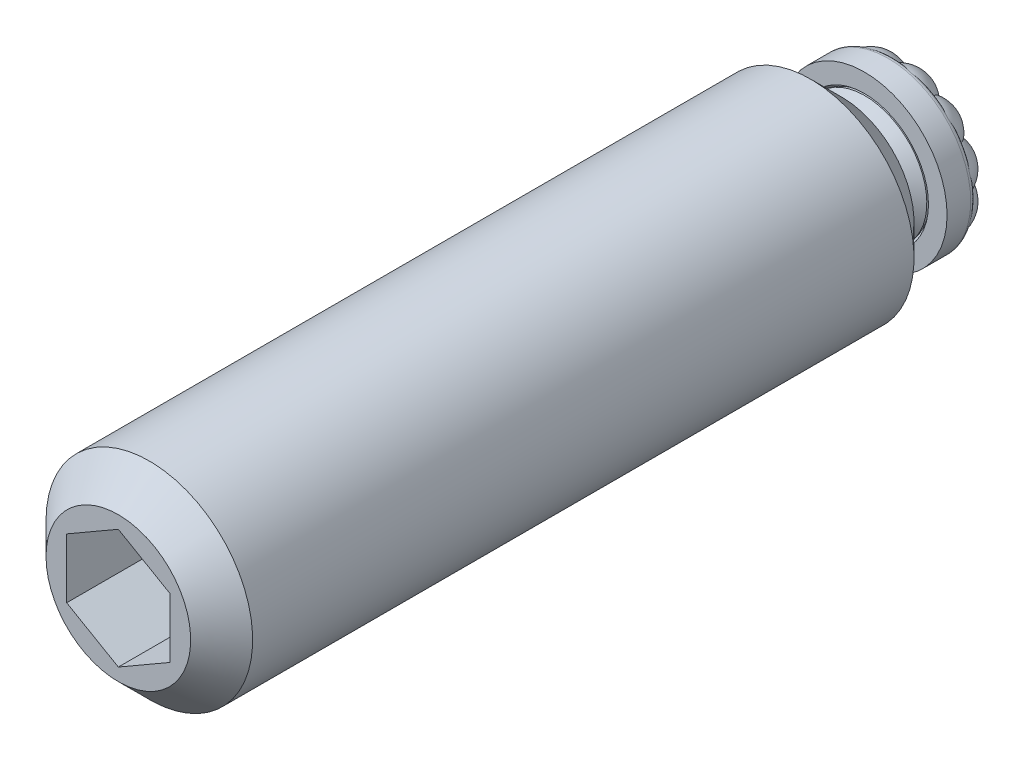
ISO-10303-21;
HEADER;
FILE_DESCRIPTION(('STEP AP214'),'2;1');
FILE_NAME('part.step','',(''),(''),'','','');
FILE_SCHEMA(('AUTOMOTIVE_DESIGN { 1 0 10303 214 1 1 1 1 }'));
ENDSEC;
DATA;
#1=APPLICATION_CONTEXT('core data for automotive mechanical design processes');
#2=APPLICATION_PROTOCOL_DEFINITION('international standard','automotive_design',2000,#1);
#3=PRODUCT_CONTEXT('',#1,'mechanical');
#4=PRODUCT('Part','Part','',(#3));
#5=PRODUCT_RELATED_PRODUCT_CATEGORY('part','',(#4));
#6=PRODUCT_DEFINITION_FORMATION('','',#4);
#7=PRODUCT_DEFINITION_CONTEXT('part definition',#1,'design');
#8=PRODUCT_DEFINITION('design','',#6,#7);
#9=PRODUCT_DEFINITION_SHAPE('','',#8);
#10=(LENGTH_UNIT() NAMED_UNIT(*) SI_UNIT(.MILLI.,.METRE.));
#11=(NAMED_UNIT(*) PLANE_ANGLE_UNIT() SI_UNIT($,.RADIAN.));
#12=(NAMED_UNIT(*) SI_UNIT($,.STERADIAN.) SOLID_ANGLE_UNIT());
#13=UNCERTAINTY_MEASURE_WITH_UNIT(LENGTH_MEASURE(1.E-05),#10,'distance_accuracy_value','');
#14=(GEOMETRIC_REPRESENTATION_CONTEXT(3) GLOBAL_UNCERTAINTY_ASSIGNED_CONTEXT((#13)) GLOBAL_UNIT_ASSIGNED_CONTEXT((#10,
#11,#12)) REPRESENTATION_CONTEXT('',''));
#15=CARTESIAN_POINT('',(0.,0.,0.));
#16=DIRECTION('',(0.,0.,1.));
#17=DIRECTION('',(1.,0.,0.));
#18=AXIS2_PLACEMENT_3D('',#15,#16,#17);
#19=CARTESIAN_POINT('',(0.,0.,3.5));
#20=DIRECTION('',(0.,0.,-1.));
#21=DIRECTION('',(-1.,0.,0.));
#22=AXIS2_PLACEMENT_3D('',#19,#20,#21);
#23=PLANE('',#22);
#24=CARTESIAN_POINT('',(0.,0.,3.5));
#25=DIRECTION('',(0.,0.,-1.));
#26=DIRECTION('',(-1.,0.,0.));
#27=AXIS2_PLACEMENT_3D('',#24,#25,#26);
#28=CIRCLE('',#27,3.5);
#29=CARTESIAN_POINT('',(-3.5,0.,3.5));
#30=VERTEX_POINT('',#29);
#31=EDGE_CURVE('E85',#30,#30,#28,.T.);
#32=ORIENTED_EDGE('',*,*,#31,.T.);
#33=EDGE_LOOP('',(#32));
#34=FACE_BOUND('',#33,.T.);
#35=CARTESIAN_POINT('',(0.,0.,3.5));
#36=DIRECTION('',(0.,0.,-1.));
#37=DIRECTION('',(-1.,0.,0.));
#38=AXIS2_PLACEMENT_3D('',#35,#36,#37);
#39=CIRCLE('',#38,2.);
#40=CARTESIAN_POINT('',(-2.,0.,3.5));
#41=VERTEX_POINT('',#40);
#42=EDGE_CURVE('E9',#41,#41,#39,.T.);
#43=ORIENTED_EDGE('',*,*,#42,.F.);
#44=EDGE_LOOP('',(#43));
#45=FACE_BOUND('',#44,.T.);
#46=ADVANCED_FACE('F14',(#34,#45),#23,.T.);
#47=CARTESIAN_POINT('',(0.,0.,38.5));
#48=DIRECTION('',(0.,0.,-1.));
#49=DIRECTION('',(-1.,0.,0.));
#50=AXIS2_PLACEMENT_3D('',#47,#48,#49);
#51=CYLINDRICAL_SURFACE('',#50,5.);
#52=CARTESIAN_POINT('',(0.,0.,5.));
#53=DIRECTION('',(0.,0.,-1.));
#54=DIRECTION('',(-1.,0.,0.));
#55=AXIS2_PLACEMENT_3D('',#52,#53,#54);
#56=CIRCLE('',#55,5.);
#57=CARTESIAN_POINT('',(-5.,0.,5.));
#58=VERTEX_POINT('',#57);
#59=EDGE_CURVE('E128',#58,#58,#56,.F.);
#60=ORIENTED_EDGE('',*,*,#59,.T.);
#61=EDGE_LOOP('',(#60));
#62=FACE_BOUND('',#61,.T.);
#63=CARTESIAN_POINT('',(0.,0.,37.));
#64=DIRECTION('',(0.,0.,-1.));
#65=DIRECTION('',(-1.,0.,0.));
#66=AXIS2_PLACEMENT_3D('',#63,#64,#65);
#67=CIRCLE('',#66,5.);
#68=CARTESIAN_POINT('',(-5.,0.,37.));
#69=VERTEX_POINT('',#68);
#70=EDGE_CURVE('E126',#69,#69,#67,.T.);
#71=ORIENTED_EDGE('',*,*,#70,.T.);
#72=EDGE_LOOP('',(#71));
#73=FACE_BOUND('',#72,.T.);
#74=ADVANCED_FACE('F887',(#62,#73),#51,.T.);
#75=CARTESIAN_POINT('',(0.,0.,38.5));
#76=DIRECTION('',(0.,0.,-1.));
#77=DIRECTION('',(-1.,0.,0.));
#78=AXIS2_PLACEMENT_3D('',#75,#76,#77);
#79=PLANE('',#78);
#80=DIRECTION('',(-0.866025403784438,-0.5,0.));
#81=VECTOR('',#80,1.);
#82=CARTESIAN_POINT('',(0.,2.88675134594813,38.5));
#83=LINE('',#82,#81);
#84=CARTESIAN_POINT('',(0.,2.88675134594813,38.5));
#85=VERTEX_POINT('',#84);
#86=CARTESIAN_POINT('',(-2.5,1.44337567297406,38.5));
#87=VERTEX_POINT('',#86);
#88=EDGE_CURVE('E101',#85,#87,#83,.T.);
#89=ORIENTED_EDGE('',*,*,#88,.F.);
#90=DIRECTION('',(-0.866025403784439,0.5,0.));
#91=VECTOR('',#90,1.);
#92=CARTESIAN_POINT('',(2.5,1.44337567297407,38.5));
#93=LINE('',#92,#91);
#94=CARTESIAN_POINT('',(2.5,1.44337567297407,38.5));
#95=VERTEX_POINT('',#94);
#96=EDGE_CURVE('E78',#95,#85,#93,.T.);
#97=ORIENTED_EDGE('',*,*,#96,.F.);
#98=DIRECTION('',(0.,1.,0.));
#99=VECTOR('',#98,1.);
#100=CARTESIAN_POINT('',(2.5,-1.44337567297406,38.5));
#101=LINE('',#100,#99);
#102=CARTESIAN_POINT('',(2.5,-1.44337567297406,38.5));
#103=VERTEX_POINT('',#102);
#104=EDGE_CURVE('E89',#103,#95,#101,.T.);
#105=ORIENTED_EDGE('',*,*,#104,.F.);
#106=DIRECTION('',(0.866025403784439,0.5,0.));
#107=VECTOR('',#106,1.);
#108=CARTESIAN_POINT('',(0.,-2.88675134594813,38.5));
#109=LINE('',#108,#107);
#110=CARTESIAN_POINT('',(0.,-2.88675134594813,38.5));
#111=VERTEX_POINT('',#110);
#112=EDGE_CURVE('E94',#111,#103,#109,.T.);
#113=ORIENTED_EDGE('',*,*,#112,.F.);
#114=DIRECTION('',(0.866025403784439,-0.5,0.));
#115=VECTOR('',#114,1.);
#116=CARTESIAN_POINT('',(-2.5,-1.44337567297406,38.5));
#117=LINE('',#116,#115);
#118=CARTESIAN_POINT('',(-2.5,-1.44337567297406,38.5));
#119=VERTEX_POINT('',#118);
#120=EDGE_CURVE('E111',#119,#111,#117,.T.);
#121=ORIENTED_EDGE('',*,*,#120,.F.);
#122=DIRECTION('',(0.,-1.,0.));
#123=VECTOR('',#122,1.);
#124=CARTESIAN_POINT('',(-2.5,1.44337567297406,38.5));
#125=LINE('',#124,#123);
#126=EDGE_CURVE('E103',#87,#119,#125,.T.);
#127=ORIENTED_EDGE('',*,*,#126,.F.);
#128=EDGE_LOOP('',(#89,#97,#105,#113,#121,#127));
#129=FACE_BOUND('',#128,.T.);
#130=CARTESIAN_POINT('',(0.,0.,38.5));
#131=DIRECTION('',(0.,0.,-1.));
#132=DIRECTION('',(-1.,0.,0.));
#133=AXIS2_PLACEMENT_3D('',#130,#131,#132);
#134=CIRCLE('',#133,3.5);
#135=CARTESIAN_POINT('',(-3.5,0.,38.5));
#136=VERTEX_POINT('',#135);
#137=EDGE_CURVE('E18',#136,#136,#134,.F.);
#138=ORIENTED_EDGE('',*,*,#137,.T.);
#139=EDGE_LOOP('',(#138));
#140=FACE_BOUND('',#139,.T.);
#141=ADVANCED_FACE('F97',(#129,#140),#79,.F.);
#142=CARTESIAN_POINT('',(0.,0.,3.5));
#143=DIRECTION('',(0.,0.,1.));
#144=DIRECTION('',(1.,0.,0.));
#145=AXIS2_PLACEMENT_3D('',#142,#143,#144);
#146=CONICAL_SURFACE('',#145,3.5,0.785398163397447);
#147=ORIENTED_EDGE('',*,*,#59,.F.);
#148=EDGE_LOOP('',(#147));
#149=FACE_BOUND('',#148,.T.);
#150=ORIENTED_EDGE('',*,*,#31,.F.);
#151=EDGE_LOOP('',(#150));
#152=FACE_BOUND('',#151,.T.);
#153=ADVANCED_FACE('F886',(#149,#152),#146,.T.);
#154=CARTESIAN_POINT('',(0.,0.,37.));
#155=DIRECTION('',(0.,0.,-1.));
#156=DIRECTION('',(-1.,0.,0.));
#157=AXIS2_PLACEMENT_3D('',#154,#155,#156);
#158=CONICAL_SURFACE('',#157,5.,0.785398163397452);
#159=ORIENTED_EDGE('',*,*,#137,.F.);
#160=EDGE_LOOP('',(#159));
#161=FACE_BOUND('',#160,.T.);
#162=ORIENTED_EDGE('',*,*,#70,.F.);
#163=EDGE_LOOP('',(#162));
#164=FACE_BOUND('',#163,.T.);
#165=ADVANCED_FACE('F16',(#161,#164),#158,.T.);
#166=CARTESIAN_POINT('',(2.5,1.44337567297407,33.5));
#167=DIRECTION('',(0.5,0.866025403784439,0.));
#168=DIRECTION('',(0.866025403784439,-0.5,0.));
#169=AXIS2_PLACEMENT_3D('',#166,#167,#168);
#170=PLANE('',#169);
#171=ORIENTED_EDGE('',*,*,#96,.T.);
#172=DIRECTION('',(0.,0.,1.));
#173=VECTOR('',#172,1.);
#174=CARTESIAN_POINT('',(0.,2.88675134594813,33.5));
#175=LINE('',#174,#173);
#176=CARTESIAN_POINT('',(0.,2.88675134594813,33.5));
#177=VERTEX_POINT('',#176);
#178=EDGE_CURVE('E122',#177,#85,#175,.T.);
#179=ORIENTED_EDGE('',*,*,#178,.F.);
#180=DIRECTION('',(-0.866025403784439,0.5,0.));
#181=VECTOR('',#180,1.);
#182=CARTESIAN_POINT('',(2.5,1.44337567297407,33.5));
#183=LINE('',#182,#181);
#184=CARTESIAN_POINT('',(2.5,1.44337567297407,33.5));
#185=VERTEX_POINT('',#184);
#186=EDGE_CURVE('E81',#185,#177,#183,.T.);
#187=ORIENTED_EDGE('',*,*,#186,.F.);
#188=DIRECTION('',(0.,0.,1.));
#189=VECTOR('',#188,1.);
#190=CARTESIAN_POINT('',(2.5,1.44337567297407,33.5));
#191=LINE('',#190,#189);
#192=EDGE_CURVE('E74',#185,#95,#191,.T.);
#193=ORIENTED_EDGE('',*,*,#192,.T.);
#194=EDGE_LOOP('',(#171,#179,#187,#193));
#195=FACE_BOUND('',#194,.T.);
#196=ADVANCED_FACE('F76',(#195),#170,.F.);
#197=CARTESIAN_POINT('',(2.5,-1.44337567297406,33.5));
#198=DIRECTION('',(1.,0.,0.));
#199=DIRECTION('',(0.,0.,-1.));
#200=AXIS2_PLACEMENT_3D('',#197,#198,#199);
#201=PLANE('',#200);
#202=ORIENTED_EDGE('',*,*,#104,.T.);
#203=ORIENTED_EDGE('',*,*,#192,.F.);
#204=DIRECTION('',(0.,1.,0.));
#205=VECTOR('',#204,1.);
#206=CARTESIAN_POINT('',(2.5,-1.44337567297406,33.5));
#207=LINE('',#206,#205);
#208=CARTESIAN_POINT('',(2.5,-1.44337567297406,33.5));
#209=VERTEX_POINT('',#208);
#210=EDGE_CURVE('E106',#209,#185,#207,.T.);
#211=ORIENTED_EDGE('',*,*,#210,.F.);
#212=DIRECTION('',(0.,0.,1.));
#213=VECTOR('',#212,1.);
#214=CARTESIAN_POINT('',(2.5,-1.44337567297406,33.5));
#215=LINE('',#214,#213);
#216=EDGE_CURVE('E86',#209,#103,#215,.T.);
#217=ORIENTED_EDGE('',*,*,#216,.T.);
#218=EDGE_LOOP('',(#202,#203,#211,#217));
#219=FACE_BOUND('',#218,.T.);
#220=ADVANCED_FACE('F90',(#219),#201,.F.);
#221=CARTESIAN_POINT('',(0.,-2.88675134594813,33.5));
#222=DIRECTION('',(0.5,-0.866025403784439,0.));
#223=DIRECTION('',(-0.866025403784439,-0.5,0.));
#224=AXIS2_PLACEMENT_3D('',#221,#222,#223);
#225=PLANE('',#224);
#226=ORIENTED_EDGE('',*,*,#112,.T.);
#227=ORIENTED_EDGE('',*,*,#216,.F.);
#228=DIRECTION('',(0.866025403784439,0.5,0.));
#229=VECTOR('',#228,1.);
#230=CARTESIAN_POINT('',(0.,-2.88675134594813,33.5));
#231=LINE('',#230,#229);
#232=CARTESIAN_POINT('',(0.,-2.88675134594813,33.5));
#233=VERTEX_POINT('',#232);
#234=EDGE_CURVE('E853',#233,#209,#231,.T.);
#235=ORIENTED_EDGE('',*,*,#234,.F.);
#236=DIRECTION('',(0.,0.,1.));
#237=VECTOR('',#236,1.);
#238=CARTESIAN_POINT('',(0.,-2.88675134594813,33.5));
#239=LINE('',#238,#237);
#240=EDGE_CURVE('E116',#233,#111,#239,.T.);
#241=ORIENTED_EDGE('',*,*,#240,.T.);
#242=EDGE_LOOP('',(#226,#227,#235,#241));
#243=FACE_BOUND('',#242,.T.);
#244=ADVANCED_FACE('F868',(#243),#225,.F.);
#245=CARTESIAN_POINT('',(-2.5,-1.44337567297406,33.5));
#246=DIRECTION('',(-0.5,-0.866025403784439,0.));
#247=DIRECTION('',(-0.866025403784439,0.5,0.));
#248=AXIS2_PLACEMENT_3D('',#245,#246,#247);
#249=PLANE('',#248);
#250=ORIENTED_EDGE('',*,*,#120,.T.);
#251=ORIENTED_EDGE('',*,*,#240,.F.);
#252=DIRECTION('',(0.866025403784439,-0.5,0.));
#253=VECTOR('',#252,1.);
#254=CARTESIAN_POINT('',(-2.5,-1.44337567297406,33.5));
#255=LINE('',#254,#253);
#256=CARTESIAN_POINT('',(-2.5,-1.44337567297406,33.5));
#257=VERTEX_POINT('',#256);
#258=EDGE_CURVE('E851',#257,#233,#255,.T.);
#259=ORIENTED_EDGE('',*,*,#258,.F.);
#260=DIRECTION('',(0.,0.,1.));
#261=VECTOR('',#260,1.);
#262=CARTESIAN_POINT('',(-2.5,-1.44337567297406,33.5));
#263=LINE('',#262,#261);
#264=EDGE_CURVE('E118',#257,#119,#263,.T.);
#265=ORIENTED_EDGE('',*,*,#264,.T.);
#266=EDGE_LOOP('',(#250,#251,#259,#265));
#267=FACE_BOUND('',#266,.T.);
#268=ADVANCED_FACE('F866',(#267),#249,.F.);
#269=CARTESIAN_POINT('',(-2.5,1.44337567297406,33.5));
#270=DIRECTION('',(-1.,0.,0.));
#271=DIRECTION('',(0.,0.,1.));
#272=AXIS2_PLACEMENT_3D('',#269,#270,#271);
#273=PLANE('',#272);
#274=ORIENTED_EDGE('',*,*,#126,.T.);
#275=ORIENTED_EDGE('',*,*,#264,.F.);
#276=DIRECTION('',(0.,-1.,0.));
#277=VECTOR('',#276,1.);
#278=CARTESIAN_POINT('',(-2.5,1.44337567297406,33.5));
#279=LINE('',#278,#277);
#280=CARTESIAN_POINT('',(-2.5,1.44337567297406,33.5));
#281=VERTEX_POINT('',#280);
#282=EDGE_CURVE('E848',#281,#257,#279,.T.);
#283=ORIENTED_EDGE('',*,*,#282,.F.);
#284=DIRECTION('',(0.,0.,1.));
#285=VECTOR('',#284,1.);
#286=CARTESIAN_POINT('',(-2.5,1.44337567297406,33.5));
#287=LINE('',#286,#285);
#288=EDGE_CURVE('E120',#281,#87,#287,.T.);
#289=ORIENTED_EDGE('',*,*,#288,.T.);
#290=EDGE_LOOP('',(#274,#275,#283,#289));
#291=FACE_BOUND('',#290,.T.);
#292=ADVANCED_FACE('F862',(#291),#273,.F.);
#293=CARTESIAN_POINT('',(0.,2.88675134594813,33.5));
#294=DIRECTION('',(-0.5,0.866025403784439,0.));
#295=DIRECTION('',(0.866025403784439,0.5,0.));
#296=AXIS2_PLACEMENT_3D('',#293,#294,#295);
#297=PLANE('',#296);
#298=ORIENTED_EDGE('',*,*,#88,.T.);
#299=ORIENTED_EDGE('',*,*,#288,.F.);
#300=DIRECTION('',(-0.866025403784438,-0.5,0.));
#301=VECTOR('',#300,1.);
#302=CARTESIAN_POINT('',(0.,2.88675134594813,33.5));
#303=LINE('',#302,#301);
#304=EDGE_CURVE('E845',#177,#281,#303,.T.);
#305=ORIENTED_EDGE('',*,*,#304,.F.);
#306=ORIENTED_EDGE('',*,*,#178,.T.);
#307=EDGE_LOOP('',(#298,#299,#305,#306));
#308=FACE_BOUND('',#307,.T.);
#309=ADVANCED_FACE('F860',(#308),#297,.F.);
#310=CARTESIAN_POINT('',(5.,0.,33.5));
#311=DIRECTION('',(0.,0.,-1.));
#312=DIRECTION('',(-1.,0.,0.));
#313=AXIS2_PLACEMENT_3D('',#310,#311,#312);
#314=PLANE('',#313);
#315=ORIENTED_EDGE('',*,*,#186,.T.);
#316=ORIENTED_EDGE('',*,*,#304,.T.);
#317=ORIENTED_EDGE('',*,*,#282,.T.);
#318=ORIENTED_EDGE('',*,*,#258,.T.);
#319=ORIENTED_EDGE('',*,*,#234,.T.);
#320=ORIENTED_EDGE('',*,*,#210,.T.);
#321=EDGE_LOOP('',(#315,#316,#317,#318,#319,#320));
#322=FACE_BOUND('',#321,.T.);
#323=ADVANCED_FACE('F205',(#322),#314,.F.);
#324=CARTESIAN_POINT('',(0.,0.,3.21279150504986));
#325=DIRECTION('',(0.,0.,-1.));
#326=DIRECTION('',(-0.965048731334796,-0.262070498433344,0.));
#327=AXIS2_PLACEMENT_3D('',#324,#325,#326);
#328=TOROIDAL_SURFACE('',#327,2.254,0.254);
#329=CARTESIAN_POINT('',(0.,0.,3.21279150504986));
#330=DIRECTION('',(0.,0.,-1.));
#331=DIRECTION('',(-0.965048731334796,-0.262070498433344,0.));
#332=AXIS2_PLACEMENT_3D('',#329,#330,#331);
#333=CIRCLE('',#332,2.);
#334=CARTESIAN_POINT('',(-1.93009746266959,-0.524140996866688,3.21279150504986));
#335=VERTEX_POINT('',#334);
#336=EDGE_CURVE('E905',#335,#335,#333,.F.);
#337=ORIENTED_EDGE('',*,*,#336,.F.);
#338=EDGE_LOOP('',(#337));
#339=FACE_BOUND('',#338,.T.);
#340=CARTESIAN_POINT('',(0.,0.,3.00472688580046));
#341=DIRECTION('',(0.,0.,-1.));
#342=DIRECTION('',(-0.965048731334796,-0.262070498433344,0.));
#343=AXIS2_PLACEMENT_3D('',#340,#341,#342);
#344=CIRCLE('',#343,2.10831158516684);
#345=CARTESIAN_POINT('',(-2.03462342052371,-0.552526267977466,3.00472688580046));
#346=VERTEX_POINT('',#345);
#347=EDGE_CURVE('E24',#346,#346,#344,.T.);
#348=ORIENTED_EDGE('',*,*,#347,.F.);
#349=EDGE_LOOP('',(#348));
#350=FACE_BOUND('',#349,.T.);
#351=ADVANCED_FACE('F200',(#339,#350),#328,.F.);
#352=CARTESIAN_POINT('',(0.,0.,1.99935993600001));
#353=DIRECTION('',(0.,0.,-1.));
#354=DIRECTION('',(-0.965048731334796,-0.262070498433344,0.));
#355=AXIS2_PLACEMENT_3D('',#352,#353,#354);
#356=CYLINDRICAL_SURFACE('',#355,2.);
#357=ORIENTED_EDGE('',*,*,#42,.T.);
#358=EDGE_LOOP('',(#357));
#359=FACE_BOUND('',#358,.T.);
#360=ORIENTED_EDGE('',*,*,#336,.T.);
#361=EDGE_LOOP('',(#360));
#362=FACE_BOUND('',#361,.T.);
#363=ADVANCED_FACE('F204',(#359,#362),#356,.T.);
#364=CARTESIAN_POINT('',(0.,0.,3.08056747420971));
#365=DIRECTION('',(0.,0.,-1.));
#366=DIRECTION('',(-0.965048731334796,-0.262070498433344,0.));
#367=AXIS2_PLACEMENT_3D('',#364,#365,#366);
#368=CONICAL_SURFACE('',#367,2.,0.959931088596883);
#369=ORIENTED_EDGE('',*,*,#347,.T.);
#370=EDGE_LOOP('',(#369));
#371=FACE_BOUND('',#370,.T.);
#372=CARTESIAN_POINT('',(0.,0.,2.38035993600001));
#373=DIRECTION('',(0.,0.,-1.));
#374=DIRECTION('',(-0.965048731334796,-0.262070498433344,0.));
#375=AXIS2_PLACEMENT_3D('',#372,#373,#374);
#376=CIRCLE('',#375,3.);
#377=CARTESIAN_POINT('',(-2.89514619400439,-0.786211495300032,2.38035993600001));
#378=VERTEX_POINT('',#377);
#379=EDGE_CURVE('E841',#378,#378,#376,.T.);
#380=ORIENTED_EDGE('',*,*,#379,.F.);
#381=EDGE_LOOP('',(#380));
#382=FACE_BOUND('',#381,.T.);
#383=ADVANCED_FACE('F209',(#371,#382),#368,.T.);
#384=CARTESIAN_POINT('',(0.,0.,2.38035993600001));
#385=DIRECTION('',(0.,0.,1.));
#386=DIRECTION('',(0.965048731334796,0.262070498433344,0.));
#387=AXIS2_PLACEMENT_3D('',#384,#385,#386);
#388=TOROIDAL_SURFACE('',#387,2.619,0.381);
#389=ORIENTED_EDGE('',*,*,#379,.T.);
#390=EDGE_LOOP('',(#389));
#391=FACE_BOUND('',#390,.T.);
#392=CARTESIAN_POINT('',(0.,0.,1.99935993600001));
#393=DIRECTION('',(0.,0.,1.));
#394=DIRECTION('',(0.965048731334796,0.262070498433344,0.));
#395=AXIS2_PLACEMENT_3D('',#392,#393,#394);
#396=CIRCLE('',#395,2.619);
#397=CARTESIAN_POINT('',(2.52746262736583,0.686362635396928,1.99935993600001));
#398=VERTEX_POINT('',#397);
#399=EDGE_CURVE('E906',#398,#398,#396,.F.);
#400=ORIENTED_EDGE('',*,*,#399,.F.);
#401=EDGE_LOOP('',(#400));
#402=FACE_BOUND('',#401,.T.);
#403=ADVANCED_FACE('F199',(#391,#402),#388,.T.);
#404=CARTESIAN_POINT('',(0.,0.,2.38060993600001));
#405=DIRECTION('',(0.,0.,1.));
#406=DIRECTION('',(0.965048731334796,0.262070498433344,0.));
#407=AXIS2_PLACEMENT_3D('',#404,#405,#406);
#408=SPHERICAL_SURFACE('',#407,2.38125);
#409=CARTESIAN_POINT('',(1.86394615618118,0.50617682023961,1.64663472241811));
#410=DIRECTION('',(-0.902108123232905,-0.24497822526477,0.355227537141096));
#411=DIRECTION('',(0.342811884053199,0.0930946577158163,0.934779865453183));
#412=AXIS2_PLACEMENT_3D('',#409,#410,#411);
#413=CIRCLE('',#412,1.18368986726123);
#414=CARTESIAN_POINT('',(1.59147290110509,0.00535958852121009,0.609300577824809));
#415=VERTEX_POINT('',#414);
#416=CARTESIAN_POINT('',(1.37557616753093,0.800377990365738,0.609300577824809));
#417=VERTEX_POINT('',#416);
#418=EDGE_CURVE('E169',#415,#417,#413,.F.);
#419=ORIENTED_EDGE('',*,*,#418,.F.);
#420=CARTESIAN_POINT('',(1.86731313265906,-0.49361109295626,1.64663472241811));
#421=DIRECTION('',(-0.903737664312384,0.238896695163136,0.355227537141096));
#422=DIRECTION('',(-0.255564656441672,-0.966791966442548,0.));
#423=AXIS2_PLACEMENT_3D('',#420,#421,#422);
#424=CIRCLE('',#423,1.18368986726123);
#425=CARTESIAN_POINT('',(1.38093575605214,-0.791094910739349,0.609300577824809));
#426=VERTEX_POINT('',#425);
#427=EDGE_CURVE('E166',#426,#415,#424,.F.);
#428=ORIENTED_EDGE('',*,*,#427,.F.);
#429=CARTESIAN_POINT('',(1.37033506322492,-1.36113631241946,1.64663472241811));
#430=DIRECTION('',(-0.663211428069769,0.658759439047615,0.355227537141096));
#431=DIRECTION('',(-0.704721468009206,-0.709484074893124,0.));
#432=AXIS2_PLACEMENT_3D('',#429,#430,#431);
#433=CIRCLE('',#432,1.18368986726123);
#434=CARTESIAN_POINT('',(0.800377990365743,-1.37557616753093,0.609300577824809));
#435=VERTEX_POINT('',#434);
#436=EDGE_CURVE('E160',#435,#426,#433,.F.);
#437=ORIENTED_EDGE('',*,*,#436,.F.);
#438=CARTESIAN_POINT('',(0.506176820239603,-1.86394615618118,1.64663472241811));
#439=DIRECTION('',(-0.244978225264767,0.902108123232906,0.355227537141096));
#440=DIRECTION('',(0.0930946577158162,-0.342811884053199,0.934779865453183));
#441=AXIS2_PLACEMENT_3D('',#438,#439,#440);
#442=CIRCLE('',#441,1.18368986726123);
#443=CARTESIAN_POINT('',(0.00535958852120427,-1.59147290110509,0.609300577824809));
#444=VERTEX_POINT('',#443);
#445=EDGE_CURVE('E157',#444,#435,#442,.F.);
#446=ORIENTED_EDGE('',*,*,#445,.F.);
#447=CARTESIAN_POINT('',(-0.493611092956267,-1.86731313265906,1.64663472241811));
#448=DIRECTION('',(0.238896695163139,0.903737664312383,0.355227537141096));
#449=DIRECTION('',(-0.966791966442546,0.255564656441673,0.));
#450=AXIS2_PLACEMENT_3D('',#447,#448,#449);
#451=CIRCLE('',#450,1.18368986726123);
#452=CARTESIAN_POINT('',(-0.791094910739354,-1.38093575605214,0.609300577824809));
#453=VERTEX_POINT('',#452);
#454=EDGE_CURVE('E154',#453,#444,#451,.F.);
#455=ORIENTED_EDGE('',*,*,#454,.F.);
#456=CARTESIAN_POINT('',(-1.36113631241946,-1.37033506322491,1.64663472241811));
#457=DIRECTION('',(0.658759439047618,0.663211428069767,0.355227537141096));
#458=DIRECTION('',(-0.709484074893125,0.704721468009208,0.));
#459=AXIS2_PLACEMENT_3D('',#456,#457,#458);
#460=CIRCLE('',#459,1.18368986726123);
#461=CARTESIAN_POINT('',(-1.37557616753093,-0.800377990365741,0.609300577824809));
#462=VERTEX_POINT('',#461);
#463=EDGE_CURVE('E151',#462,#453,#460,.F.);
#464=ORIENTED_EDGE('',*,*,#463,.F.);
#465=CARTESIAN_POINT('',(-1.86394615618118,-0.506176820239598,1.64663472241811));
#466=DIRECTION('',(0.902108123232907,0.244978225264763,0.355227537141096));
#467=DIRECTION('',(0.342811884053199,0.0930946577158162,-0.934779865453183));
#468=AXIS2_PLACEMENT_3D('',#465,#466,#467);
#469=CIRCLE('',#468,1.18368986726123);
#470=CARTESIAN_POINT('',(-1.5914729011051,-0.00535958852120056,0.609300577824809));
#471=VERTEX_POINT('',#470);
#472=EDGE_CURVE('E148',#471,#462,#469,.F.);
#473=ORIENTED_EDGE('',*,*,#472,.F.);
#474=CARTESIAN_POINT('',(-1.86731313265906,0.493611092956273,1.64663472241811));
#475=DIRECTION('',(0.903737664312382,-0.238896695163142,0.355227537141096));
#476=DIRECTION('',(0.25556465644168,0.966791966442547,0.));
#477=AXIS2_PLACEMENT_3D('',#474,#475,#476);
#478=CIRCLE('',#477,1.18368986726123);
#479=CARTESIAN_POINT('',(-1.38093575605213,0.791094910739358,0.609300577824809));
#480=VERTEX_POINT('',#479);
#481=EDGE_CURVE('E142',#480,#471,#478,.F.);
#482=ORIENTED_EDGE('',*,*,#481,.F.);
#483=CARTESIAN_POINT('',(-1.37033506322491,1.36113631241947,1.64663472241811));
#484=DIRECTION('',(0.663211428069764,-0.658759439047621,0.355227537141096));
#485=DIRECTION('',(0.704721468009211,0.709484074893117,0.));
#486=AXIS2_PLACEMENT_3D('',#483,#484,#485);
#487=CIRCLE('',#486,1.18368986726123);
#488=CARTESIAN_POINT('',(-0.800377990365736,1.37557616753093,0.609300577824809));
#489=VERTEX_POINT('',#488);
#490=EDGE_CURVE('E134',#489,#480,#487,.F.);
#491=ORIENTED_EDGE('',*,*,#490,.F.);
#492=CARTESIAN_POINT('',(-0.506176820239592,1.86394615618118,1.64663472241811));
#493=DIRECTION('',(0.24497822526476,-0.902108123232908,0.355227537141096));
#494=DIRECTION('',(0.0930946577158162,-0.342811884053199,-0.934779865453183));
#495=AXIS2_PLACEMENT_3D('',#492,#493,#494);
#496=CIRCLE('',#495,1.18368986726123);
#497=CARTESIAN_POINT('',(-0.0053595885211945,1.59147290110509,0.609300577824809));
#498=VERTEX_POINT('',#497);
#499=EDGE_CURVE('E33',#498,#489,#496,.F.);
#500=ORIENTED_EDGE('',*,*,#499,.F.);
#501=CARTESIAN_POINT('',(0.493611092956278,1.86731313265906,1.64663472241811));
#502=DIRECTION('',(-0.238896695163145,-0.903737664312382,0.355227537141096));
#503=DIRECTION('',(0.966791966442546,-0.255564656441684,0.));
#504=AXIS2_PLACEMENT_3D('',#501,#502,#503);
#505=CIRCLE('',#504,1.18368986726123);
#506=CARTESIAN_POINT('',(0.791094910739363,1.38093575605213,0.609300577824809));
#507=VERTEX_POINT('',#506);
#508=EDGE_CURVE('E811',#507,#498,#505,.F.);
#509=ORIENTED_EDGE('',*,*,#508,.F.);
#510=CARTESIAN_POINT('',(1.36113631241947,1.3703350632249,1.64663472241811));
#511=DIRECTION('',(-0.658759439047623,-0.663211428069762,0.355227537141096));
#512=DIRECTION('',(0.709484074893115,-0.704721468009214,0.));
#513=AXIS2_PLACEMENT_3D('',#510,#511,#512);
#514=CIRCLE('',#513,1.18368986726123);
#515=EDGE_CURVE('E163',#417,#507,#514,.F.);
#516=ORIENTED_EDGE('',*,*,#515,.F.);
#517=EDGE_LOOP('',(#419,#428,#437,#446,#455,#464,#473,#482,#491,#500,#509,#516));
#518=FACE_BOUND('',#517,.T.);
#519=ADVANCED_FACE('F195',(#518),#408,.T.);
#520=CARTESIAN_POINT('',(0.,0.,0.999359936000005));
#521=DIRECTION('',(0.,0.,1.));
#522=DIRECTION('',(0.262070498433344,-0.965048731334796,0.));
#523=AXIS2_PLACEMENT_3D('',#520,#521,#522);
#524=PLANE('',#523);
#525=CARTESIAN_POINT('',(2.52423339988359,-0.667263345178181,0.999359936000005));
#526=DIRECTION('',(0.,0.,1.));
#527=DIRECTION('',(-0.255564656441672,-0.966791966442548,0.));
#528=AXIS2_PLACEMENT_3D('',#525,#526,#527);
#529=CIRCLE('',#528,1.33346353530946);
#530=CARTESIAN_POINT('',(3.31804421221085,-1.7387060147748,0.999359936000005));
#531=VERTEX_POINT('',#530);
#532=CARTESIAN_POINT('',(3.18579842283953,-1.82504429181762,0.999359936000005));
#533=VERTEX_POINT('',#532);
#534=EDGE_CURVE('E311',#531,#533,#529,.F.);
#535=ORIENTED_EDGE('',*,*,#534,.F.);
#536=CARTESIAN_POINT('',(0.,0.,0.999359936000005));
#537=DIRECTION('',(0.,0.,-1.));
#538=DIRECTION('',(-0.262070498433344,0.965048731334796,0.));
#539=AXIS2_PLACEMENT_3D('',#536,#537,#538);
#540=CIRCLE('',#539,3.746);
#541=CARTESIAN_POINT('',(3.17821251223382,-1.98279631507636,0.999359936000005));
#542=VERTEX_POINT('',#541);
#543=EDGE_CURVE('E345',#531,#542,#540,.T.);
#544=ORIENTED_EDGE('',*,*,#543,.T.);
#545=CARTESIAN_POINT('',(1.85241857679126,-1.83998370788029,0.999359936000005));
#546=DIRECTION('',(0.,0.,1.));
#547=DIRECTION('',(-0.704721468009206,-0.709484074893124,0.));
#548=AXIS2_PLACEMENT_3D('',#545,#546,#547);
#549=CIRCLE('',#548,1.33346353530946);
#550=EDGE_CURVE('E562',#533,#542,#549,.F.);
#551=ORIENTED_EDGE('',*,*,#550,.F.);
#552=EDGE_LOOP('',(#535,#544,#551));
#553=FACE_BOUND('',#552,.T.);
#554=ADVANCED_FACE('F198',(#553),#524,.F.);
#555=CARTESIAN_POINT('',(1.85241857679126,-1.83998370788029,1.38842243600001));
#556=DIRECTION('',(0.,0.,-1.));
#557=DIRECTION('',(0.709484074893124,-0.704721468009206,0.));
#558=AXIS2_PLACEMENT_3D('',#555,#556,#557);
#559=SPHERICAL_SURFACE('',#558,1.3890625);
#560=CARTESIAN_POINT('',(1.26833413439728,-2.17983281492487,1.38842243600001));
#561=DIRECTION('',(-0.864336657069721,-0.502913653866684,0.));
#562=DIRECTION('',(0.502913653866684,-0.864336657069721,0.));
#563=AXIS2_PLACEMENT_3D('',#560,#561,#562);
#564=CIRCLE('',#563,1.21360725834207);
#565=CARTESIAN_POINT('',(1.84646021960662,-3.1734339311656,0.999359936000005));
#566=VERTEX_POINT('',#565);
#567=EDGE_CURVE('E309',#435,#566,#564,.T.);
#568=ORIENTED_EDGE('',*,*,#567,.F.);
#569=ORIENTED_EDGE('',*,*,#436,.T.);
#570=CARTESIAN_POINT('',(2.18832598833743,-1.25362352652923,1.38842243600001));
#571=DIRECTION('',(-0.497080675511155,-0.867704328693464,0.));
#572=DIRECTION('',(0.867704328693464,-0.497080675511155,0.));
#573=AXIS2_PLACEMENT_3D('',#570,#571,#572);
#574=CIRCLE('',#573,1.21360725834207);
#575=EDGE_CURVE('E314',#426,#533,#574,.T.);
#576=ORIENTED_EDGE('',*,*,#575,.T.);
#577=ORIENTED_EDGE('',*,*,#550,.T.);
#578=CARTESIAN_POINT('',(3.17796791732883,-1.44726793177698,1.25355993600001));
#579=CARTESIAN_POINT('',(3.1772679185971,-1.44875046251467,1.24235210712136));
#580=CARTESIAN_POINT('',(3.17682605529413,-1.45151663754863,1.23138401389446));
#581=CARTESIAN_POINT('',(3.17635990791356,-1.45909058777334,1.21033094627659));
#582=CARTESIAN_POINT('',(3.17632976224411,-1.46386870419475,1.20023561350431));
#583=CARTESIAN_POINT('',(3.1765732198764,-1.47496340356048,1.18107880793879));
#584=CARTESIAN_POINT('',(3.17684427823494,-1.48126674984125,1.1720093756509));
#585=CARTESIAN_POINT('',(3.17758359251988,-1.49506229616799,1.15479039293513));
#586=CARTESIAN_POINT('',(3.17805265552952,-1.50255928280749,1.14664478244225));
#587=CARTESIAN_POINT('',(3.17951004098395,-1.52461612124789,1.12526229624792));
#588=CARTESIAN_POINT('',(3.18061792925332,-1.54012212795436,1.11301283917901));
#589=CARTESIAN_POINT('',(3.18283958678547,-1.57277856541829,1.09098682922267));
#590=CARTESIAN_POINT('',(3.18395336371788,-1.589932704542,1.08121604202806));
#591=CARTESIAN_POINT('',(3.18670831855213,-1.63821318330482,1.05733295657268));
#592=CARTESIAN_POINT('',(3.18813801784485,-1.67036802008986,1.04528484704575));
#593=CARTESIAN_POINT('',(3.18974165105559,-1.73605908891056,1.02587031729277));
#594=CARTESIAN_POINT('',(3.18991261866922,-1.76959839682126,1.01851499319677));
#595=CARTESIAN_POINT('',(3.18826199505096,-1.85905082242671,1.00394827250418));
#596=CARTESIAN_POINT('',(3.18508561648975,-1.91545637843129,0.999883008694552));
#597=CARTESIAN_POINT('',(3.17368938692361,-2.02768935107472,0.998932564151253));
#598=CARTESIAN_POINT('',(3.16546784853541,-2.08351656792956,1.00204978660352));
#599=CARTESIAN_POINT('',(3.14013901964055,-2.21104431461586,1.01547854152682));
#600=CARTESIAN_POINT('',(3.12103954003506,-2.28215824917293,1.02775966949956));
#601=CARTESIAN_POINT('',(3.08498361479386,-2.38544391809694,1.05054161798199));
#602=CARTESIAN_POINT('',(3.07165726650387,-2.41944660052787,1.05890766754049));
#603=CARTESIAN_POINT('',(3.04246830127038,-2.48608148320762,1.07660351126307));
#604=CARTESIAN_POINT('',(3.02660701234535,-2.51871438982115,1.08593279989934));
#605=CARTESIAN_POINT('',(2.99753956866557,-2.57262646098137,1.10189599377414));
#606=CARTESIAN_POINT('',(2.98502584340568,-2.5943000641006,1.10847268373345));
#607=CARTESIAN_POINT('',(2.95864534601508,-2.63689680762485,1.12130011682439));
#608=CARTESIAN_POINT('',(2.94477937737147,-2.65782038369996,1.12755105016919));
#609=CARTESIAN_POINT('',(2.91580517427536,-2.69850891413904,1.13885994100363));
#610=CARTESIAN_POINT('',(2.90072600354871,-2.71828842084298,1.14393855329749));
#611=CARTESIAN_POINT('',(2.86892574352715,-2.75692518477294,1.15164718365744));
#612=CARTESIAN_POINT('',(2.85221215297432,-2.77578610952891,1.15428785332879));
#613=CARTESIAN_POINT('',(2.81982658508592,-2.80946940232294,1.15566534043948));
#614=CARTESIAN_POINT('',(2.80437037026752,-2.82447482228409,1.15492513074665));
#615=CARTESIAN_POINT('',(2.77263580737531,-2.85330131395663,1.15104610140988));
#616=CARTESIAN_POINT('',(2.75635521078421,-2.86711883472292,1.14790035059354));
#617=CARTESIAN_POINT('',(2.72293875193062,-2.89379899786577,1.14014287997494));
#618=CARTESIAN_POINT('',(2.70579318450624,-2.90664200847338,1.13550771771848));
#619=CARTESIAN_POINT('',(2.67096206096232,-2.93125010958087,1.12555678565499));
#620=CARTESIAN_POINT('',(2.65327680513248,-2.94301578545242,1.12024138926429));
#621=CARTESIAN_POINT('',(2.60343791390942,-2.97433286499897,1.10518120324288));
#622=CARTESIAN_POINT('',(2.57069899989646,-2.99284700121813,1.09519781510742));
#623=CARTESIAN_POINT('',(2.503631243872,-3.02708681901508,1.07582165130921));
#624=CARTESIAN_POINT('',(2.46930160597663,-3.04281108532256,1.06642917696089));
#625=CARTESIAN_POINT('',(2.36459381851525,-3.08573909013,1.04026713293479));
#626=CARTESIAN_POINT('',(2.29202992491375,-3.10898504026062,1.02534906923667));
#627=CARTESIAN_POINT('',(2.1613353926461,-3.14078119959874,1.00707556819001));
#628=CARTESIAN_POINT('',(2.10398964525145,-3.15153101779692,1.00178979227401));
#629=CARTESIAN_POINT('',(1.98823509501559,-3.16746181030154,0.998231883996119));
#630=CARTESIAN_POINT('',(1.92982734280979,-3.17264801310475,0.999953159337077));
#631=CARTESIAN_POINT('',(1.83976930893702,-3.17689128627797,1.01018408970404));
#632=CARTESIAN_POINT('',(1.80780303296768,-3.17765030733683,1.01532386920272));
#633=CARTESIAN_POINT('',(1.74465594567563,-3.17787483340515,1.02929816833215));
#634=CARTESIAN_POINT('',(1.71347443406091,-3.17734153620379,1.03812926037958));
#635=CARTESIAN_POINT('',(1.66193474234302,-3.17563885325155,1.05713685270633));
#636=CARTESIAN_POINT('',(1.64113072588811,-3.17470766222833,1.06611929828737));
#637=CARTESIAN_POINT('',(1.60097114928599,-3.17259558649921,1.0868873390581));
#638=CARTESIAN_POINT('',(1.58161256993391,-3.17141524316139,1.09866686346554));
#639=CARTESIAN_POINT('',(1.55269441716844,-3.16961106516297,1.12021651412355));
#640=CARTESIAN_POINT('',(1.54232377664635,-3.16895424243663,1.12889117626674));
#641=CARTESIAN_POINT('',(1.52286734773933,-3.1677946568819,1.14761018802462));
#642=CARTESIAN_POINT('',(1.51378058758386,-3.16729177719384,1.1576534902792));
#643=CARTESIAN_POINT('',(1.49935636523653,-3.16667581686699,1.17667351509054));
#644=CARTESIAN_POINT('',(1.49363812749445,-3.16649937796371,1.18535729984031));
#645=CARTESIAN_POINT('',(1.48365055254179,-3.16641431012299,1.20350842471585));
#646=CARTESIAN_POINT('',(1.47937616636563,-3.16650473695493,1.21297288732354));
#647=CARTESIAN_POINT('',(1.47427828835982,-3.16690223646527,1.2277368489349));
#648=CARTESIAN_POINT('',(1.4727887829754,-3.16708200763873,1.23281421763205));
#649=CARTESIAN_POINT('',(1.47031921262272,-3.16753953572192,1.24310097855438));
#650=CARTESIAN_POINT('',(1.46934052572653,-3.16781755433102,1.24831068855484));
#651=CARTESIAN_POINT('',(1.46863968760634,-3.16814804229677,1.25355993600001));
#652=B_SPLINE_CURVE_WITH_KNOTS('',3,(#578,#579,#580,#581,#582,#583,#584,#585,#586,#587,#588,
#589,#590,#591,#592,#593,#594,#595,#596,#597,#598,#599,#600,#601,#602,#603,#604,#605,#606,#607,
#608,#609,#610,#611,#612,#613,#614,#615,#616,#617,#618,#619,#620,#621,#622,#623,#624,#625,#626,
#627,#628,#629,#630,#631,#632,#633,#634,#635,#636,#637,#638,#639,#640,#641,#642,#643,#644,#645,
#646,#647,#648,#649,#650,#651),.UNSPECIFIED.,.F.,.F.,(4,2,2,2,2,2,2,2,2,2,2,2,2,2,2,2,2,2,2,2,2,
2,2,2,2,2,2,2,2,2,2,2,2,2,2,2,4),(0.,0.0337831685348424,0.067084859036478,0.100107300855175,
0.133265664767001,0.192299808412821,0.251470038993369,0.353992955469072,0.456757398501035,
0.625733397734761,0.79476594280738,1.01745457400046,1.1297656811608,1.24201814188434,
1.31960951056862,1.39715505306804,1.47320732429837,1.54892572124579,1.61336391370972,
1.67798847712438,1.7436845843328,1.809344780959,1.92591955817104,2.04255330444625,
2.27412506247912,2.44934331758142,2.62439676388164,2.72137912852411,2.81827163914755,
2.88616012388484,2.95390258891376,2.99441599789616,3.03489857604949,3.06599129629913,
3.09697413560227,3.11283290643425,3.1287342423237),.UNSPECIFIED.);
#653=CARTESIAN_POINT('',(2.0041575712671,-3.16478568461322,0.999359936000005));
#654=VERTEX_POINT('',#653);
#655=EDGE_CURVE('E555',#542,#654,#652,.T.);
#656=ORIENTED_EDGE('',*,*,#655,.T.);
#657=EDGE_CURVE('E565',#654,#566,#549,.F.);
#658=ORIENTED_EDGE('',*,*,#657,.T.);
#659=EDGE_LOOP('',(#568,#569,#576,#577,#656,#658));
#660=FACE_BOUND('',#659,.T.);
#661=ADVANCED_FACE('F193',(#660),#559,.T.);
#662=ORIENTED_EDGE('',*,*,#657,.F.);
#663=CARTESIAN_POINT('',(1.76101461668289,-3.30625823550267,0.999359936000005));
#664=VERTEX_POINT('',#663);
#665=EDGE_CURVE('E351',#654,#664,#540,.T.);
#666=ORIENTED_EDGE('',*,*,#665,.T.);
#667=CARTESIAN_POINT('',(0.684249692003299,-2.51968192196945,0.999359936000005));
#668=DIRECTION('',(0.,0.,1.));
#669=DIRECTION('',(-0.965048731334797,-0.26207049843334,0.));
#670=AXIS2_PLACEMENT_3D('',#667,#668,#669);
#671=CIRCLE('',#670,1.33346353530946);
#672=EDGE_CURVE('E640',#566,#664,#671,.F.);
#673=ORIENTED_EDGE('',*,*,#672,.F.);
#674=EDGE_LOOP('',(#662,#666,#673));
#675=FACE_BOUND('',#674,.T.);
#676=ADVANCED_FACE('F532',(#675),#524,.F.);
#677=CARTESIAN_POINT('',(0.684249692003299,-2.51968192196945,1.38842243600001));
#678=DIRECTION('',(0.,0.,-1.));
#679=DIRECTION('',(0.26207049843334,-0.965048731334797,0.));
#680=AXIS2_PLACEMENT_3D('',#677,#678,#679);
#681=SPHERICAL_SURFACE('',#680,1.3890625);
#682=CARTESIAN_POINT('',(0.00849317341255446,-2.52195766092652,1.38842243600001));
#683=DIRECTION('',(-0.999994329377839,-0.00336767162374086,0.));
#684=DIRECTION('',(0.00336767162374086,-0.999994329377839,0.));
#685=AXIS2_PLACEMENT_3D('',#682,#683,#684);
#686=CIRCLE('',#685,1.21360725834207);
#687=CARTESIAN_POINT('',(0.0123644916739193,-3.67150451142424,0.999359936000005));
#688=VERTEX_POINT('',#687);
#689=EDGE_CURVE('E563',#444,#688,#686,.T.);
#690=ORIENTED_EDGE('',*,*,#689,.F.);
#691=ORIENTED_EDGE('',*,*,#445,.T.);
#692=ORIENTED_EDGE('',*,*,#567,.T.);
#693=ORIENTED_EDGE('',*,*,#672,.T.);
#694=CARTESIAN_POINT('',(2.0285669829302,-2.84235475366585,1.25355993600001));
#695=CARTESIAN_POINT('',(2.02721950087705,-2.84328866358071,1.24235210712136));
#696=CARTESIAN_POINT('',(2.0254537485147,-2.84546330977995,1.23138401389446));
#697=CARTESIAN_POINT('',(2.02126307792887,-2.85178946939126,1.21033094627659));
#698=CARTESIAN_POINT('',(2.01884791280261,-2.85591236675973,1.20023561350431));
#699=CARTESIAN_POINT('',(2.01351140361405,-2.86564238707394,1.18107880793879));
#700=CARTESIAN_POINT('',(2.01059447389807,-2.87123677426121,1.1720093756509));
#701=CARTESIAN_POINT('',(2.00433696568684,-2.88355372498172,1.15479039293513));
#702=CARTESIAN_POINT('',(2.00099469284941,-2.89028083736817,1.14664478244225));
#703=CARTESIAN_POINT('',(1.99122840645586,-2.91011131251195,1.12526229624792));
#704=CARTESIAN_POINT('',(1.98443486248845,-2.92409385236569,1.11301283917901));
#705=CARTESIAN_POINT('',(1.97003065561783,-2.95348598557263,1.09098682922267));
#706=CARTESIAN_POINT('',(1.96241814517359,-2.96889879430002,1.08121604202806));
#707=CARTESIAN_POINT('',(1.94066376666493,-3.01208839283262,1.05733295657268));
#708=CARTESIAN_POINT('',(1.92582450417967,-3.04065014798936,1.04528484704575));
#709=CARTESIAN_POINT('',(1.89436775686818,-3.09834209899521,1.02587031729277));
#710=CARTESIAN_POINT('',(1.87774616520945,-3.12747347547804,1.01851499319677));
#711=CARTESIAN_POINT('',(1.83159047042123,-3.20411623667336,1.00394827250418));
#712=CARTESIAN_POINT('',(1.80063686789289,-3.25137669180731,0.999883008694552));
#713=CARTESIAN_POINT('',(1.73465095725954,-3.3428751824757,0.998932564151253));
#714=CARTESIAN_POINT('',(1.69961728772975,-3.38711220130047,1.00204978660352));
#715=CARTESIAN_POINT('',(1.61391800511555,-3.48489005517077,1.01547854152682));
#716=CARTESIAN_POINT('',(1.56182040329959,-3.5369267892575,1.02775966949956));
#717=CARTESIAN_POINT('',(1.47895222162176,-3.60834683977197,1.05054161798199));
#718=CARTESIAN_POINT('',(1.45040992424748,-3.63113085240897,1.05890766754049));
#719=CARTESIAN_POINT('',(1.39181409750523,-3.67424387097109,1.07660351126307));
#720=CARTESIAN_POINT('',(1.36176136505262,-3.69457415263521,1.08593279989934));
#721=CARTESIAN_POINT('',(1.30963218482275,-3.72672965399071,1.10189599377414));
#722=CARTESIAN_POINT('',(1.28795817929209,-3.73924268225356,1.10847268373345));
#723=CARTESIAN_POINT('',(1.24381362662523,-3.76294229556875,1.12130011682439));
#724=CARTESIAN_POINT('',(1.22134355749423,-3.774129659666,1.12755105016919));
#725=CARTESIAN_POINT('',(1.17590689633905,-3.79487985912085,1.13885994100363));
#726=CARTESIAN_POINT('',(1.15295819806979,-3.80446982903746,1.14393855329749));
#727=CARTESIAN_POINT('',(1.10609998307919,-3.82203011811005,1.15164718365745));
#728=CARTESIAN_POINT('',(1.082195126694,-3.83000736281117,1.15428785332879));
#729=CARTESIAN_POINT('',(1.03730675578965,-3.84298516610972,1.15566534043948));
#730=CARTESIAN_POINT('',(1.01641857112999,-3.84825213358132,1.15492513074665));
#731=CARTESIAN_POINT('',(0.974522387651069,-3.85734932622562,1.15104610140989));
#732=CARTESIAN_POINT('',(0.953514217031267,-3.86117535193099,1.14790035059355));
#733=CARTESIAN_POINT('',(0.911234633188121,-3.86757282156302,1.14014287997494));
#734=CARTESIAN_POINT('',(0.889964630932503,-3.87012241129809,1.13550771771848));
#735=CARTESIAN_POINT('',(0.847495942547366,-3.87401809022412,1.12555678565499));
#736=CARTESIAN_POINT('',(0.826297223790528,-3.87536483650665,1.12024138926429));
#737=CARTESIAN_POINT('',(0.76747693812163,-3.87756677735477,1.10518120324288));
#738=CARTESIAN_POINT('',(0.729867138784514,-3.8772310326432,1.09519781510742));
#739=CARTESIAN_POINT('',(0.654664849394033,-3.87334970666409,1.07582165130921));
#740=CARTESIAN_POINT('',(0.617072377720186,-3.86980250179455,1.06642917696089));
#741=CARTESIAN_POINT('',(0.504928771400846,-3.85462535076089,1.04026713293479));
#742=CARTESIAN_POINT('',(0.430463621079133,-3.83847498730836,1.02534906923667));
#743=CARTESIAN_POINT('',(0.301380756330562,-3.80066400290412,1.00707556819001));
#744=CARTESIAN_POINT('',(0.246342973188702,-3.78130074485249,1.00178979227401));
#745=CARTESIAN_POINT('',(0.138131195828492,-3.73721994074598,0.99823188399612));
#746=CARTESIAN_POINT('',(0.0849554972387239,-3.71250744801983,0.999953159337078));
#747=CARTESIAN_POINT('',(0.00484131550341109,-3.67115321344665,1.01018408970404));
#748=CARTESIAN_POINT('',(-0.0232218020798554,-3.65582740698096,1.01532386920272));
#749=CARTESIAN_POINT('',(-0.0780210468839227,-3.62444830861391,1.02929816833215));
#750=CARTESIAN_POINT('',(-0.104758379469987,-3.60839570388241,1.03812926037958));
#751=CARTESIAN_POINT('',(-0.148541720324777,-3.58115129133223,1.05713685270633));
#752=CARTESIAN_POINT('',(-0.166092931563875,-3.56994284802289,1.06611929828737));
#753=CARTESIAN_POINT('',(-0.199816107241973,-3.54803394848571,1.0868873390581));
#754=CARTESIAN_POINT('',(-0.215990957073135,-3.53733245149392,1.09866686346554));
#755=CARTESIAN_POINT('',(-0.240132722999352,-3.52131091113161,1.12021651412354));
#756=CARTESIAN_POINT('',(-0.248785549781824,-3.51555676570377,1.12889117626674));
#757=CARTESIAN_POINT('',(-0.265055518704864,-3.504824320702,1.14761018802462));
#758=CARTESIAN_POINT('',(-0.272673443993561,-3.49984543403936,1.1576534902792));
#759=CARTESIAN_POINT('',(-0.284857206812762,-3.49209988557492,1.17667351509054));
#760=CARTESIAN_POINT('',(-0.289721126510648,-3.48908796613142,1.18535729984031));
#761=CARTESIAN_POINT('',(-0.29832808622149,-3.48402050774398,1.20350842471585));
#762=CARTESIAN_POINT('',(-0.3020750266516,-3.48196162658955,1.21297288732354));
#763=CARTESIAN_POINT('',(-0.306688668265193,-3.47975693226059,1.2277368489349));
#764=CARTESIAN_POINT('',(-0.308068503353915,-3.47916786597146,1.23281421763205));
#765=CARTESIAN_POINT('',(-0.310435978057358,-3.47832931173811,1.24310097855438));
#766=CARTESIAN_POINT('',(-0.311422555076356,-3.47808073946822,1.24831068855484));
#767=CARTESIAN_POINT('',(-0.312194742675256,-3.47801653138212,1.25355993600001));
#768=B_SPLINE_CURVE_WITH_KNOTS('',3,(#694,#695,#696,#697,#698,#699,#700,#701,#702,#703,#704,
#705,#706,#707,#708,#709,#710,#711,#712,#713,#714,#715,#716,#717,#718,#719,#720,#721,#722,#723,
#724,#725,#726,#727,#728,#729,#730,#731,#732,#733,#734,#735,#736,#737,#738,#739,#740,#741,#742,
#743,#744,#745,#746,#747,#748,#749,#750,#751,#752,#753,#754,#755,#756,#757,#758,#759,#760,#761,
#762,#763,#764,#765,#766,#767),.UNSPECIFIED.,.F.,.F.,(4,2,2,2,2,2,2,2,2,2,2,2,2,2,2,2,2,2,2,2,2,
2,2,2,2,2,2,2,2,2,2,2,2,2,2,2,4),(0.,0.0337831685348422,0.0670848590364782,0.100107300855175,
0.133265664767,0.19229980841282,0.25147003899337,0.353992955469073,0.456757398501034,
0.625733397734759,0.79476594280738,1.01745457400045,1.1297656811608,1.24201814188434,
1.31960951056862,1.39715505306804,1.47320732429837,1.54892572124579,1.61336391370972,
1.67798847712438,1.74368458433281,1.809344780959,1.92591955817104,2.04255330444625,
2.27412506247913,2.44934331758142,2.62439676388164,2.72137912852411,2.81827163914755,
2.88616012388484,2.95390258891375,2.99441599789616,3.03489857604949,3.06599129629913,
3.09697413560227,3.11283290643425,3.1287342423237),.UNSPECIFIED.);
#769=CARTESIAN_POINT('',(0.153258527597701,-3.74286358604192,0.999359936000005));
#770=VERTEX_POINT('',#769);
#771=EDGE_CURVE('E644',#664,#770,#768,.T.);
#772=ORIENTED_EDGE('',*,*,#771,.T.);
#773=EDGE_CURVE('E643',#770,#688,#671,.F.);
#774=ORIENTED_EDGE('',*,*,#773,.T.);
#775=EDGE_LOOP('',(#690,#691,#692,#693,#772,#774));
#776=FACE_BOUND('',#775,.T.);
#777=ADVANCED_FACE('F528',(#776),#681,.T.);
#778=ORIENTED_EDGE('',*,*,#773,.F.);
#779=CARTESIAN_POINT('',(-0.128045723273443,-3.74381093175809,0.999359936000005));
#780=VERTEX_POINT('',#779);
#781=EDGE_CURVE('E358',#770,#780,#540,.T.);
#782=ORIENTED_EDGE('',*,*,#781,.T.);
#783=CARTESIAN_POINT('',(-0.667263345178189,-2.52423339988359,0.999359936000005));
#784=DIRECTION('',(0.,0.,1.));
#785=DIRECTION('',(-0.966791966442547,0.255564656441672,0.));
#786=AXIS2_PLACEMENT_3D('',#783,#784,#785);
#787=CIRCLE('',#786,1.33346353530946);
#788=EDGE_CURVE('E657',#688,#780,#787,.F.);
#789=ORIENTED_EDGE('',*,*,#788,.F.);
#790=EDGE_LOOP('',(#778,#782,#789));
#791=FACE_BOUND('',#790,.T.);
#792=ADVANCED_FACE('F521',(#791),#524,.F.);
#793=CARTESIAN_POINT('',(-0.667263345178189,-2.52423339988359,1.38842243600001));
#794=DIRECTION('',(0.,0.,-1.));
#795=DIRECTION('',(-0.255564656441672,-0.966791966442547,0.));
#796=AXIS2_PLACEMENT_3D('',#793,#794,#795);
#797=SPHERICAL_SURFACE('',#796,1.3890625);
#798=CARTESIAN_POINT('',(-1.25362352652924,-2.18832598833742,1.38842243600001));
#799=DIRECTION('',(-0.867704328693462,0.497080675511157,0.));
#800=DIRECTION('',(-0.497080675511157,-0.867704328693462,0.));
#801=AXIS2_PLACEMENT_3D('',#798,#799,#800);
#802=CIRCLE('',#801,1.21360725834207);
#803=CARTESIAN_POINT('',(-1.82504429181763,-3.18579842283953,0.999359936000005));
#804=VERTEX_POINT('',#803);
#805=EDGE_CURVE('E646',#453,#804,#802,.T.);
#806=ORIENTED_EDGE('',*,*,#805,.F.);
#807=ORIENTED_EDGE('',*,*,#454,.T.);
#808=ORIENTED_EDGE('',*,*,#689,.T.);
#809=ORIENTED_EDGE('',*,*,#788,.T.);
#810=CARTESIAN_POINT('',(0.335613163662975,-3.47583491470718,1.25355993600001));
#811=CARTESIAN_POINT('',(0.333979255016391,-3.47596996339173,1.24235210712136));
#812=CARTESIAN_POINT('',(0.331362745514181,-3.47697038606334,1.23138401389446));
#813=CARTESIAN_POINT('',(0.324570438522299,-3.48035366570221,1.21033094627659));
#814=CARTESIAN_POINT('',(0.320417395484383,-3.48271661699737,1.20023561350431));
#815=CARTESIAN_POINT('',(0.310930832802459,-3.48847480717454,1.18107880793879));
#816=CARTESIAN_POINT('',(0.305607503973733,-3.49186122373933,1.1720093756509));
#817=CARTESIAN_POINT('',(0.294029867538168,-3.49939926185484,1.15479039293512));
#818=CARTESIAN_POINT('',(0.287771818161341,-3.5035539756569,1.14664478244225));
#819=CARTESIAN_POINT('',(0.269398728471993,-3.51584452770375,1.12526229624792));
#820=CARTESIAN_POINT('',(0.25652407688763,-3.52455699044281,1.113012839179));
#821=CARTESIAN_POINT('',(0.229353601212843,-3.54280922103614,1.09098682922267));
#822=CARTESIAN_POINT('',(0.215054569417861,-3.55235084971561,1.08121604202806));
#823=CARTESIAN_POINT('',(0.174619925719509,-3.57887694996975,1.05733295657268));
#824=CARTESIAN_POINT('',(0.147487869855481,-3.59619252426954,1.04528484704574));
#825=CARTESIAN_POINT('',(0.0913995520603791,-3.63042684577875,1.02587031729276));
#826=CARTESIAN_POINT('',(0.0624391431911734,-3.64734456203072,1.01851499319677));
#827=CARTESIAN_POINT('',(-0.0158542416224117,-3.69064129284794,1.00394827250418));
#828=CARTESIAN_POINT('',(-0.0662910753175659,-3.71609324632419,0.999883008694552));
#829=CARTESIAN_POINT('',(-0.169185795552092,-3.76234030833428,0.998932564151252));
#830=CARTESIAN_POINT('',(-0.221644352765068,-3.78313385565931,1.00204978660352));
#831=CARTESIAN_POINT('',(-0.344751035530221,-3.8249623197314,1.01547854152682));
#832=CARTESIAN_POINT('',(-0.415887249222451,-3.84397865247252,1.02775966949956));
#833=CARTESIAN_POINT('',(-0.523363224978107,-3.86439613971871,1.050541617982));
#834=CARTESIAN_POINT('',(-0.5594735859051,-3.86985652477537,1.0589076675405));
#835=CARTESIAN_POINT('',(-0.631775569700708,-3.87789558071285,1.07660351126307));
#836=CARTESIAN_POINT('',(-0.667967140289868,-3.88047575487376,1.08593279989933));
#837=CARTESIAN_POINT('',(-0.729190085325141,-3.88225864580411,1.10189599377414));
#838=CARTESIAN_POINT('',(-0.754216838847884,-3.8822582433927,1.10847268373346));
#839=CARTESIAN_POINT('',(-0.804296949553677,-3.88071043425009,1.12130011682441));
#840=CARTESIAN_POINT('',(-0.829350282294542,-3.8791639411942,1.1275510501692));
#841=CARTESIAN_POINT('',(-0.879074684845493,-3.87441581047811,1.13885994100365));
#842=CARTESIAN_POINT('',(-0.903743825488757,-3.87124661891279,1.14393855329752));
#843=CARTESIAN_POINT('',(-0.953104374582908,-3.86302516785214,1.15164718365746));
#844=CARTESIAN_POINT('',(-0.977795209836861,-3.85798123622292,1.15428785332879));
#845=CARTESIAN_POINT('',(-1.02315858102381,-3.8467761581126,1.15566534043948));
#846=CARTESIAN_POINT('',(-1.04388176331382,-3.84089339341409,1.15492513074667));
#847=CARTESIAN_POINT('',(-1.08471351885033,-3.82782370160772,1.15104610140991));
#848=CARTESIAN_POINT('',(-1.1048201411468,-3.8206330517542,1.14790035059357));
#849=CARTESIAN_POINT('',(-1.14463406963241,-3.8050336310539,1.14014287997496));
#850=CARTESIAN_POINT('',(-1.16432922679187,-3.7966066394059,1.1355077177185));
#851=CARTESIAN_POINT('',(-1.20305602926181,-3.77874605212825,1.12555678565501));
#852=CARTESIAN_POINT('',(-1.22208803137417,-3.76931300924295,1.1202413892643));
#853=CARTESIAN_POINT('',(-1.27412886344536,-3.7418098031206,1.10518120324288));
#854=CARTESIAN_POINT('',(-1.30653203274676,-3.72271414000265,1.09519781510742));
#855=CARTESIAN_POINT('',(-1.36971846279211,-3.68175166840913,1.07582165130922));
#856=CARTESIAN_POINT('',(-1.40050089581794,-3.65988346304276,1.0664291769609));
#857=CARTESIAN_POINT('',(-1.49003153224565,-3.59066786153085,1.04026713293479));
#858=CARTESIAN_POINT('',(-1.54644506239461,-3.53944866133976,1.02534906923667));
#859=CARTESIAN_POINT('',(-1.63932861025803,-3.44216195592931,1.00707556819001));
#860=CARTESIAN_POINT('',(-1.67731109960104,-3.39787399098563,1.00178979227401));
#861=CARTESIAN_POINT('',(-1.74898484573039,-3.30559300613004,0.99823188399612));
#862=CARTESIAN_POINT('',(-1.78268010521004,-3.25760351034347,0.999953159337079));
#863=CARTESIAN_POINT('',(-1.83138390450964,-3.18173260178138,1.01018408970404));
#864=CARTESIAN_POINT('',(-1.84802437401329,-3.15442850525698,1.01532386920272));
#865=CARTESIAN_POINT('',(-1.87979236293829,-3.09985378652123,1.02929816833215));
#866=CARTESIAN_POINT('',(-1.89492126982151,-3.07258315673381,1.03812926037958));
#867=CARTESIAN_POINT('',(-1.91921654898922,-3.02709713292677,1.05713685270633));
#868=CARTESIAN_POINT('',(-1.9288121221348,-3.00861473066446,1.06611929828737));
#869=CARTESIAN_POINT('',(-1.94706279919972,-2.97277947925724,1.08688733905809));
#870=CARTESIAN_POINT('',(-1.95571988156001,-2.95542428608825,1.09866686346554));
#871=CARTESIAN_POINT('',(-1.96861649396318,-2.92947834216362,1.12021651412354));
#872=CARTESIAN_POINT('',(-1.97323298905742,-2.9201686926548,1.12889117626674));
#873=CARTESIAN_POINT('',(-1.98195697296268,-2.90273913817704,1.14761018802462));
#874=CARTESIAN_POINT('',(-1.9860648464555,-2.89461833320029,1.1576534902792));
#875=CARTESIAN_POINT('',(-1.99274352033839,-2.88181861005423,1.17667351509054));
#876=CARTESIAN_POINT('',(-1.99544983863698,-2.87677825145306,1.18535729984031));
#877=CARTESIAN_POINT('',(-2.0003699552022,-2.8680862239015,1.20350842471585));
#878=CARTESIAN_POINT('',(-2.00258546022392,-2.86442971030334,1.21297288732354));
#879=CARTESIAN_POINT('',(-2.00547864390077,-2.86021356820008,1.2277368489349));
#880=CARTESIAN_POINT('',(-2.00637908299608,-2.85901350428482,1.23281421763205));
#881=CARTESIAN_POINT('',(-2.0080100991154,-2.85710355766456,1.24310097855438));
#882=CARTESIAN_POINT('',(-2.0087402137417,-2.85639499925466,1.24831068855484));
#883=CARTESIAN_POINT('',(-2.00937684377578,-2.85595329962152,1.25355993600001));
#884=B_SPLINE_CURVE_WITH_KNOTS('',3,(#810,#811,#812,#813,#814,#815,#816,#817,#818,#819,#820,
#821,#822,#823,#824,#825,#826,#827,#828,#829,#830,#831,#832,#833,#834,#835,#836,#837,#838,#839,
#840,#841,#842,#843,#844,#845,#846,#847,#848,#849,#850,#851,#852,#853,#854,#855,#856,#857,#858,
#859,#860,#861,#862,#863,#864,#865,#866,#867,#868,#869,#870,#871,#872,#873,#874,#875,#876,#877,
#878,#879,#880,#881,#882,#883),.UNSPECIFIED.,.F.,.F.,(4,2,2,2,2,2,2,2,2,2,2,2,2,2,2,2,2,2,2,2,2,
2,2,2,2,2,2,2,2,2,2,2,2,2,2,2,4),(0.,0.033783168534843,0.0670848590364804,0.100107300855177,
0.133265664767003,0.192299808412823,0.251470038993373,0.353992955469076,0.456757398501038,
0.625733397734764,0.794765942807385,1.01745457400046,1.1297656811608,1.24201814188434,
1.31960951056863,1.39715505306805,1.47320732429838,1.5489257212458,1.61336391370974,
1.67798847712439,1.74368458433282,1.80934478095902,1.92591955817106,2.04255330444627,
2.27412506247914,2.44934331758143,2.62439676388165,2.72137912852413,2.81827163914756,
2.88616012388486,2.95390258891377,2.99441599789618,3.03489857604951,3.06599129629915,
3.09697413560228,3.11283290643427,3.12873424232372),.UNSPECIFIED.);
#885=CARTESIAN_POINT('',(-1.73870601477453,-3.318044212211,0.999359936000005));
#886=VERTEX_POINT('',#885);
#887=EDGE_CURVE('E658',#780,#886,#884,.T.);
#888=ORIENTED_EDGE('',*,*,#887,.T.);
#889=EDGE_CURVE('E654',#886,#804,#787,.F.);
#890=ORIENTED_EDGE('',*,*,#889,.T.);
#891=EDGE_LOOP('',(#806,#807,#808,#809,#888,#890));
#892=FACE_BOUND('',#891,.T.);
#893=ADVANCED_FACE('F517',(#892),#797,.T.);
#894=ORIENTED_EDGE('',*,*,#889,.F.);
#895=CARTESIAN_POINT('',(-1.98279631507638,-3.17821251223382,0.999359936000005));
#896=VERTEX_POINT('',#895);
#897=EDGE_CURVE('E366',#886,#896,#540,.T.);
#898=ORIENTED_EDGE('',*,*,#897,.T.);
#899=CARTESIAN_POINT('',(-1.83998370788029,-1.85241857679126,0.999359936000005));
#900=DIRECTION('',(0.,0.,1.));
#901=DIRECTION('',(-0.709484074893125,0.704721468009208,0.));
#902=AXIS2_PLACEMENT_3D('',#899,#900,#901);
#903=CIRCLE('',#902,1.33346353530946);
#904=EDGE_CURVE('E671',#804,#896,#903,.F.);
#905=ORIENTED_EDGE('',*,*,#904,.F.);
#906=EDGE_LOOP('',(#894,#898,#905));
#907=FACE_BOUND('',#906,.T.);
#908=ADVANCED_FACE('F510',(#907),#524,.F.);
#909=CARTESIAN_POINT('',(-1.83998370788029,-1.85241857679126,1.38842243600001));
#910=DIRECTION('',(0.,0.,-1.));
#911=DIRECTION('',(-0.704721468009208,-0.709484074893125,0.));
#912=AXIS2_PLACEMENT_3D('',#909,#910,#911);
#913=SPHERICAL_SURFACE('',#912,1.3890625);
#914=CARTESIAN_POINT('',(-2.17983281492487,-1.26833413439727,1.38842243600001));
#915=DIRECTION('',(-0.502913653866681,0.864336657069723,0.));
#916=DIRECTION('',(-0.864336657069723,-0.502913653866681,0.));
#917=AXIS2_PLACEMENT_3D('',#914,#915,#916);
#918=CIRCLE('',#917,1.21360725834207);
#919=CARTESIAN_POINT('',(-3.17343393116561,-1.84646021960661,0.999359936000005));
#920=VERTEX_POINT('',#919);
#921=EDGE_CURVE('E665',#462,#920,#918,.T.);
#922=ORIENTED_EDGE('',*,*,#921,.F.);
#923=ORIENTED_EDGE('',*,*,#463,.T.);
#924=ORIENTED_EDGE('',*,*,#805,.T.);
#925=ORIENTED_EDGE('',*,*,#904,.T.);
#926=CARTESIAN_POINT('',(-1.44726793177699,-3.17796791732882,1.25355993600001));
#927=CARTESIAN_POINT('',(-1.44875046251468,-3.17726791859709,1.24235210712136));
#928=CARTESIAN_POINT('',(-1.45151663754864,-3.17682605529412,1.23138401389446));
#929=CARTESIAN_POINT('',(-1.45909058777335,-3.17635990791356,1.21033094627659));
#930=CARTESIAN_POINT('',(-1.46386870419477,-3.17632976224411,1.20023561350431));
#931=CARTESIAN_POINT('',(-1.47496340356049,-3.1765732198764,1.18107880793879));
#932=CARTESIAN_POINT('',(-1.48126674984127,-3.17684427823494,1.1720093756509));
#933=CARTESIAN_POINT('',(-1.495062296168,-3.17758359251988,1.15479039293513));
#934=CARTESIAN_POINT('',(-1.5025592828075,-3.17805265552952,1.14664478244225));
#935=CARTESIAN_POINT('',(-1.52461612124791,-3.17951004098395,1.12526229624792));
#936=CARTESIAN_POINT('',(-1.54012212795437,-3.18061792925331,1.113012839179));
#937=CARTESIAN_POINT('',(-1.57277856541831,-3.18283958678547,1.09098682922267));
#938=CARTESIAN_POINT('',(-1.58993270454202,-3.18395336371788,1.08121604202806));
#939=CARTESIAN_POINT('',(-1.63821318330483,-3.18670831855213,1.05733295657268));
#940=CARTESIAN_POINT('',(-1.67036802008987,-3.18813801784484,1.04528484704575));
#941=CARTESIAN_POINT('',(-1.73605908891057,-3.18974165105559,1.02587031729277));
#942=CARTESIAN_POINT('',(-1.76959839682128,-3.18991261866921,1.01851499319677));
#943=CARTESIAN_POINT('',(-1.85905082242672,-3.18826199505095,1.00394827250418));
#944=CARTESIAN_POINT('',(-1.9154563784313,-3.18508561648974,0.999883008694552));
#945=CARTESIAN_POINT('',(-2.02768935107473,-3.17368938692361,0.998932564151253));
#946=CARTESIAN_POINT('',(-2.08351656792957,-3.1654678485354,1.00204978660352));
#947=CARTESIAN_POINT('',(-2.21104431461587,-3.14013901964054,1.01547854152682));
#948=CARTESIAN_POINT('',(-2.28215824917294,-3.12103954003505,1.02775966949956));
#949=CARTESIAN_POINT('',(-2.38544391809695,-3.08498361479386,1.05054161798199));
#950=CARTESIAN_POINT('',(-2.41944660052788,-3.07165726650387,1.05890766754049));
#951=CARTESIAN_POINT('',(-2.48608148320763,-3.04246830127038,1.07660351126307));
#952=CARTESIAN_POINT('',(-2.51871438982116,-3.02660701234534,1.08593279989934));
#953=CARTESIAN_POINT('',(-2.57262646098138,-2.99753956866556,1.10189599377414));
#954=CARTESIAN_POINT('',(-2.59430006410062,-2.98502584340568,1.10847268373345));
#955=CARTESIAN_POINT('',(-2.63689680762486,-2.95864534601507,1.1213001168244));
#956=CARTESIAN_POINT('',(-2.65782038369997,-2.94477937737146,1.12755105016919));
#957=CARTESIAN_POINT('',(-2.69850891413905,-2.91580517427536,1.13885994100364));
#958=CARTESIAN_POINT('',(-2.71828842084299,-2.9007260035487,1.1439385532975));
#959=CARTESIAN_POINT('',(-2.75692518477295,-2.86892574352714,1.15164718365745));
#960=CARTESIAN_POINT('',(-2.77578610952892,-2.85221215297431,1.15428785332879));
#961=CARTESIAN_POINT('',(-2.80946940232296,-2.81982658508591,1.15566534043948));
#962=CARTESIAN_POINT('',(-2.82447482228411,-2.80437037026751,1.15492513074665));
#963=CARTESIAN_POINT('',(-2.85330131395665,-2.7726358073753,1.15104610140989));
#964=CARTESIAN_POINT('',(-2.86711883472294,-2.7563552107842,1.14790035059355));
#965=CARTESIAN_POINT('',(-2.89379899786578,-2.72293875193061,1.14014287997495));
#966=CARTESIAN_POINT('',(-2.90664200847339,-2.70579318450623,1.13550771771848));
#967=CARTESIAN_POINT('',(-2.93125010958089,-2.67096206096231,1.125556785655));
#968=CARTESIAN_POINT('',(-2.94301578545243,-2.65327680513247,1.12024138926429));
#969=CARTESIAN_POINT('',(-2.97433286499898,-2.60343791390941,1.10518120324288));
#970=CARTESIAN_POINT('',(-2.99284700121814,-2.57069899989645,1.09519781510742));
#971=CARTESIAN_POINT('',(-3.0270868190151,-2.50363124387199,1.07582165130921));
#972=CARTESIAN_POINT('',(-3.04281108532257,-2.46930160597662,1.06642917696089));
#973=CARTESIAN_POINT('',(-3.08573909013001,-2.36459381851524,1.04026713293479));
#974=CARTESIAN_POINT('',(-3.10898504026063,-2.29202992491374,1.02534906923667));
#975=CARTESIAN_POINT('',(-3.14078119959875,-2.16133539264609,1.00707556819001));
#976=CARTESIAN_POINT('',(-3.15153101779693,-2.10398964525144,1.00178979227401));
#977=CARTESIAN_POINT('',(-3.16746181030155,-1.98823509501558,0.99823188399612));
#978=CARTESIAN_POINT('',(-3.17264801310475,-1.92982734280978,0.999953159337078));
#979=CARTESIAN_POINT('',(-3.17689128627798,-1.83976930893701,1.01018408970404));
#980=CARTESIAN_POINT('',(-3.17765030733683,-1.80780303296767,1.01532386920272));
#981=CARTESIAN_POINT('',(-3.17787483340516,-1.74465594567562,1.02929816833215));
#982=CARTESIAN_POINT('',(-3.1773415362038,-1.7134744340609,1.03812926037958));
#983=CARTESIAN_POINT('',(-3.17563885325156,-1.66193474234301,1.05713685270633));
#984=CARTESIAN_POINT('',(-3.17470766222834,-1.64113072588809,1.06611929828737));
#985=CARTESIAN_POINT('',(-3.17259558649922,-1.60097114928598,1.0868873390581));
#986=CARTESIAN_POINT('',(-3.17141524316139,-1.5816125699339,1.09866686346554));
#987=CARTESIAN_POINT('',(-3.16961106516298,-1.55269441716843,1.12021651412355));
#988=CARTESIAN_POINT('',(-3.16895424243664,-1.54232377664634,1.12889117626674));
#989=CARTESIAN_POINT('',(-3.16779465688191,-1.52286734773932,1.14761018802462));
#990=CARTESIAN_POINT('',(-3.16729177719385,-1.51378058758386,1.1576534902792));
#991=CARTESIAN_POINT('',(-3.166675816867,-1.49935636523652,1.17667351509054));
#992=CARTESIAN_POINT('',(-3.16649937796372,-1.49363812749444,1.18535729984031));
#993=CARTESIAN_POINT('',(-3.166414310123,-1.48365055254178,1.20350842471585));
#994=CARTESIAN_POINT('',(-3.16650473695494,-1.47937616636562,1.21297288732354));
#995=CARTESIAN_POINT('',(-3.16690223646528,-1.47427828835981,1.2277368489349));
#996=CARTESIAN_POINT('',(-3.16708200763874,-1.47278878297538,1.23281421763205));
#997=CARTESIAN_POINT('',(-3.16753953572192,-1.4703192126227,1.24310097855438));
#998=CARTESIAN_POINT('',(-3.16781755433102,-1.46934052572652,1.24831068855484));
#999=CARTESIAN_POINT('',(-3.16814804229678,-1.46863968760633,1.25355993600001));
#1000=B_SPLINE_CURVE_WITH_KNOTS('',3,(#926,#927,#928,#929,#930,#931,#932,#933,#934,#935,#936,
#937,#938,#939,#940,#941,#942,#943,#944,#945,#946,#947,#948,#949,#950,#951,#952,#953,#954,#955,
#956,#957,#958,#959,#960,#961,#962,#963,#964,#965,#966,#967,#968,#969,#970,#971,#972,#973,#974,
#975,#976,#977,#978,#979,#980,#981,#982,#983,#984,#985,#986,#987,#988,#989,#990,#991,#992,#993,
#994,#995,#996,#997,#998,#999),.UNSPECIFIED.,.F.,.F.,(4,2,2,2,2,2,2,2,2,2,2,2,2,2,2,2,2,2,2,2,2,
2,2,2,2,2,2,2,2,2,2,2,2,2,2,2,4),(0.,0.0337831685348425,0.0670848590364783,0.100107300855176,
0.133265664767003,0.192299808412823,0.251470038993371,0.353992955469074,0.456757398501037,
0.625733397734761,0.794765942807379,1.01745457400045,1.1297656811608,1.24201814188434,
1.31960951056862,1.39715505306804,1.47320732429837,1.54892572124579,1.61336391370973,
1.67798847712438,1.74368458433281,1.80934478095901,1.92591955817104,2.04255330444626,
2.27412506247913,2.44934331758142,2.62439676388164,2.72137912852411,2.81827163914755,
2.88616012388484,2.95390258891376,2.99441599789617,3.0348985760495,3.06599129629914,
3.09697413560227,3.11283290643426,3.1287342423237),.UNSPECIFIED.);
#1001=CARTESIAN_POINT('',(-3.16478568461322,-2.0041575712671,0.999359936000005));
#1002=VERTEX_POINT('',#1001);
#1003=EDGE_CURVE('E672',#896,#1002,#1000,.T.);
#1004=ORIENTED_EDGE('',*,*,#1003,.T.);
#1005=EDGE_CURVE('E668',#1002,#920,#903,.F.);
#1006=ORIENTED_EDGE('',*,*,#1005,.T.);
#1007=EDGE_LOOP('',(#922,#923,#924,#925,#1004,#1006));
#1008=FACE_BOUND('',#1007,.T.);
#1009=ADVANCED_FACE('F506',(#1008),#913,.T.);
#1010=ORIENTED_EDGE('',*,*,#1005,.F.);
#1011=CARTESIAN_POINT('',(-3.30625823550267,-1.76101461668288,0.999359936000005));
#1012=VERTEX_POINT('',#1011);
#1013=EDGE_CURVE('E374',#1002,#1012,#540,.T.);
#1014=ORIENTED_EDGE('',*,*,#1013,.T.);
#1015=CARTESIAN_POINT('',(-2.51968192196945,-0.684249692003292,0.999359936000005));
#1016=DIRECTION('',(0.,0.,1.));
#1017=DIRECTION('',(-0.262070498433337,0.965048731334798,0.));
#1018=AXIS2_PLACEMENT_3D('',#1015,#1016,#1017);
#1019=CIRCLE('',#1018,1.33346353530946);
#1020=EDGE_CURVE('E685',#920,#1012,#1019,.F.);
#1021=ORIENTED_EDGE('',*,*,#1020,.F.);
#1022=EDGE_LOOP('',(#1010,#1014,#1021));
#1023=FACE_BOUND('',#1022,.T.);
#1024=ADVANCED_FACE('F502',(#1023),#524,.F.);
#1025=CARTESIAN_POINT('',(-2.51968192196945,-0.684249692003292,1.38842243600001));
#1026=DIRECTION('',(0.,0.,-1.));
#1027=DIRECTION('',(-0.965048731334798,-0.262070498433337,0.));
#1028=AXIS2_PLACEMENT_3D('',#1025,#1026,#1027);
#1029=SPHERICAL_SURFACE('',#1028,1.3890625);
#1030=CARTESIAN_POINT('',(-2.52195766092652,-0.00849317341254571,1.38842243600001));
#1031=DIRECTION('',(-0.00336767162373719,0.999994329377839,0.));
#1032=DIRECTION('',(-0.99999432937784,-0.00336767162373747,0.));
#1033=AXIS2_PLACEMENT_3D('',#1030,#1031,#1032);
#1034=CIRCLE('',#1033,1.21360725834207);
#1035=CARTESIAN_POINT('',(-3.67150451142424,-0.0123644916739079,0.999359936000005));
#1036=VERTEX_POINT('',#1035);
#1037=EDGE_CURVE('E679',#471,#1036,#1034,.T.);
#1038=ORIENTED_EDGE('',*,*,#1037,.F.);
#1039=ORIENTED_EDGE('',*,*,#472,.T.);
#1040=ORIENTED_EDGE('',*,*,#921,.T.);
#1041=ORIENTED_EDGE('',*,*,#1020,.T.);
#1042=CARTESIAN_POINT('',(-2.84235475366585,-2.02856698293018,1.25355993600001));
#1043=CARTESIAN_POINT('',(-2.84328866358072,-2.02721950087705,1.24235210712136));
#1044=CARTESIAN_POINT('',(-2.84546330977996,-2.0254537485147,1.23138401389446));
#1045=CARTESIAN_POINT('',(-2.85178946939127,-2.02126307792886,1.21033094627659));
#1046=CARTESIAN_POINT('',(-2.85591236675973,-2.0188479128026,1.20023561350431));
#1047=CARTESIAN_POINT('',(-2.86564238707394,-2.01351140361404,1.18107880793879));
#1048=CARTESIAN_POINT('',(-2.87123677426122,-2.01059447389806,1.1720093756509));
#1049=CARTESIAN_POINT('',(-2.88355372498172,-2.00433696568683,1.15479039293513));
#1050=CARTESIAN_POINT('',(-2.89028083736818,-2.0009946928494,1.14664478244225));
#1051=CARTESIAN_POINT('',(-2.91011131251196,-1.99122840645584,1.12526229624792));
#1052=CARTESIAN_POINT('',(-2.92409385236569,-1.98443486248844,1.113012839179));
#1053=CARTESIAN_POINT('',(-2.95348598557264,-1.97003065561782,1.09098682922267));
#1054=CARTESIAN_POINT('',(-2.96889879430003,-1.96241814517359,1.08121604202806));
#1055=CARTESIAN_POINT('',(-3.01208839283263,-1.94066376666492,1.05733295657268));
#1056=CARTESIAN_POINT('',(-3.04065014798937,-1.92582450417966,1.04528484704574));
#1057=CARTESIAN_POINT('',(-3.09834209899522,-1.89436775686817,1.02587031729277));
#1058=CARTESIAN_POINT('',(-3.12747347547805,-1.87774616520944,1.01851499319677));
#1059=CARTESIAN_POINT('',(-3.20411623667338,-1.83159047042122,1.00394827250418));
#1060=CARTESIAN_POINT('',(-3.25137669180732,-1.80063686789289,0.999883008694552));
#1061=CARTESIAN_POINT('',(-3.34287518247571,-1.73465095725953,0.998932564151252));
#1062=CARTESIAN_POINT('',(-3.38711220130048,-1.69961728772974,1.00204978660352));
#1063=CARTESIAN_POINT('',(-3.48489005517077,-1.61391800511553,1.01547854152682));
#1064=CARTESIAN_POINT('',(-3.53692678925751,-1.56182040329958,1.02775966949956));
#1065=CARTESIAN_POINT('',(-3.60834683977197,-1.47895222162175,1.05054161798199));
#1066=CARTESIAN_POINT('',(-3.63113085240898,-1.45040992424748,1.05890766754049));
#1067=CARTESIAN_POINT('',(-3.67424387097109,-1.39181409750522,1.07660351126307));
#1068=CARTESIAN_POINT('',(-3.69457415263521,-1.36176136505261,1.08593279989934));
#1069=CARTESIAN_POINT('',(-3.72672965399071,-1.30963218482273,1.10189599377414));
#1070=CARTESIAN_POINT('',(-3.73924268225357,-1.28795817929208,1.10847268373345));
#1071=CARTESIAN_POINT('',(-3.76294229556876,-1.24381362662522,1.1213001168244));
#1072=CARTESIAN_POINT('',(-3.77412965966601,-1.22134355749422,1.12755105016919));
#1073=CARTESIAN_POINT('',(-3.79487985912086,-1.17590689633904,1.13885994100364));
#1074=CARTESIAN_POINT('',(-3.80446982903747,-1.15295819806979,1.1439385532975));
#1075=CARTESIAN_POINT('',(-3.82203011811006,-1.10609998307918,1.15164718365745));
#1076=CARTESIAN_POINT('',(-3.83000736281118,-1.08219512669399,1.15428785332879));
#1077=CARTESIAN_POINT('',(-3.84298516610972,-1.03730675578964,1.15566534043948));
#1078=CARTESIAN_POINT('',(-3.84825213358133,-1.01641857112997,1.15492513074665));
#1079=CARTESIAN_POINT('',(-3.85734932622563,-0.974522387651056,1.1510461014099));
#1080=CARTESIAN_POINT('',(-3.861175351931,-0.953514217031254,1.14790035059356));
#1081=CARTESIAN_POINT('',(-3.86757282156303,-0.911234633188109,1.14014287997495));
#1082=CARTESIAN_POINT('',(-3.8701224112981,-0.88996463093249,1.13550771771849));
#1083=CARTESIAN_POINT('',(-3.87401809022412,-0.847495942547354,1.125556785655));
#1084=CARTESIAN_POINT('',(-3.87536483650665,-0.826297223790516,1.12024138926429));
#1085=CARTESIAN_POINT('',(-3.87756677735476,-0.767476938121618,1.10518120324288));
#1086=CARTESIAN_POINT('',(-3.87723103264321,-0.729867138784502,1.09519781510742));
#1087=CARTESIAN_POINT('',(-3.8733497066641,-0.65466484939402,1.07582165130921));
#1088=CARTESIAN_POINT('',(-3.86980250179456,-0.617072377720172,1.0664291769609));
#1089=CARTESIAN_POINT('',(-3.85462535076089,-0.504928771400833,1.0402671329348));
#1090=CARTESIAN_POINT('',(-3.83847498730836,-0.430463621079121,1.02534906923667));
#1091=CARTESIAN_POINT('',(-3.80066400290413,-0.30138075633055,1.00707556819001));
#1092=CARTESIAN_POINT('',(-3.78130074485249,-0.24634297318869,1.00178979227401));
#1093=CARTESIAN_POINT('',(-3.73721994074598,-0.138131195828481,0.99823188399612));
#1094=CARTESIAN_POINT('',(-3.71250744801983,-0.0849554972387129,0.999953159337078));
#1095=CARTESIAN_POINT('',(-3.67115321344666,-0.00484131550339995,1.01018408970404));
#1096=CARTESIAN_POINT('',(-3.65582740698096,0.0232218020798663,1.01532386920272));
#1097=CARTESIAN_POINT('',(-3.62444830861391,0.0780210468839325,1.02929816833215));
#1098=CARTESIAN_POINT('',(-3.60839570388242,0.104758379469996,1.03812926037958));
#1099=CARTESIAN_POINT('',(-3.58115129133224,0.148541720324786,1.05713685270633));
#1100=CARTESIAN_POINT('',(-3.5699428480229,0.166092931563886,1.06611929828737));
#1101=CARTESIAN_POINT('',(-3.54803394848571,0.199816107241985,1.08688733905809));
#1102=CARTESIAN_POINT('',(-3.53733245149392,0.215990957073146,1.09866686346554));
#1103=CARTESIAN_POINT('',(-3.52131091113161,0.240132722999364,1.12021651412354));
#1104=CARTESIAN_POINT('',(-3.51555676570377,0.248785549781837,1.12889117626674));
#1105=CARTESIAN_POINT('',(-3.504824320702,0.265055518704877,1.14761018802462));
#1106=CARTESIAN_POINT('',(-3.49984543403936,0.272673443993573,1.1576534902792));
#1107=CARTESIAN_POINT('',(-3.49209988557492,0.284857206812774,1.17667351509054));
#1108=CARTESIAN_POINT('',(-3.48908796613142,0.289721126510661,1.18535729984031));
#1109=CARTESIAN_POINT('',(-3.48402050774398,0.298328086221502,1.20350842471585));
#1110=CARTESIAN_POINT('',(-3.48196162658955,0.302075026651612,1.21297288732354));
#1111=CARTESIAN_POINT('',(-3.47975693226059,0.306688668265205,1.2277368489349));
#1112=CARTESIAN_POINT('',(-3.47916786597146,0.308068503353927,1.23281421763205));
#1113=CARTESIAN_POINT('',(-3.4783293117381,0.31043597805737,1.24310097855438));
#1114=CARTESIAN_POINT('',(-3.47808073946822,0.311422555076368,1.24831068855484));
#1115=CARTESIAN_POINT('',(-3.47801653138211,0.312194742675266,1.25355993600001));
#1116=B_SPLINE_CURVE_WITH_KNOTS('',3,(#1042,#1043,#1044,#1045,#1046,#1047,#1048,#1049,#1050,
#1051,#1052,#1053,#1054,#1055,#1056,#1057,#1058,#1059,#1060,#1061,#1062,#1063,#1064,#1065,#1066,
#1067,#1068,#1069,#1070,#1071,#1072,#1073,#1074,#1075,#1076,#1077,#1078,#1079,#1080,#1081,#1082,
#1083,#1084,#1085,#1086,#1087,#1088,#1089,#1090,#1091,#1092,#1093,#1094,#1095,#1096,#1097,#1098,
#1099,#1100,#1101,#1102,#1103,#1104,#1105,#1106,#1107,#1108,#1109,#1110,#1111,#1112,#1113,#1114,
#1115),.UNSPECIFIED.,.F.,.F.,(4,2,2,2,2,2,2,2,2,2,2,2,2,2,2,2,2,2,2,2,2,2,2,2,2,2,2,2,2,2,2,2,2,
2,2,2,4),(0.,0.0337831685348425,0.0670848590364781,0.100107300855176,0.133265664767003,
0.192299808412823,0.251470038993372,0.353992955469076,0.456757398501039,0.625733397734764,
0.794765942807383,1.01745457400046,1.1297656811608,1.24201814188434,1.31960951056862,
1.39715505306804,1.47320732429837,1.54892572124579,1.61336391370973,1.67798847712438,
1.74368458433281,1.80934478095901,1.92591955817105,2.04255330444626,2.27412506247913,
2.44934331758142,2.62439676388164,2.72137912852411,2.81827163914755,2.88616012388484,
2.95390258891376,2.99441599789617,3.0348985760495,3.06599129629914,3.09697413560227,
3.11283290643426,3.12873424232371),.UNSPECIFIED.);
#1117=CARTESIAN_POINT('',(-3.74286358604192,-0.153258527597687,0.999359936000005));
#1118=VERTEX_POINT('',#1117);
#1119=EDGE_CURVE('E686',#1012,#1118,#1116,.T.);
#1120=ORIENTED_EDGE('',*,*,#1119,.T.);
#1121=EDGE_CURVE('E682',#1118,#1036,#1019,.F.);
#1122=ORIENTED_EDGE('',*,*,#1121,.T.);
#1123=EDGE_LOOP('',(#1038,#1039,#1040,#1041,#1120,#1122));
#1124=FACE_BOUND('',#1123,.T.);
#1125=ADVANCED_FACE('F497',(#1124),#1029,.T.);
#1126=ORIENTED_EDGE('',*,*,#1121,.F.);
#1127=CARTESIAN_POINT('',(-3.74381093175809,0.128045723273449,0.999359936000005));
#1128=VERTEX_POINT('',#1127);
#1129=EDGE_CURVE('E382',#1118,#1128,#540,.T.);
#1130=ORIENTED_EDGE('',*,*,#1129,.T.);
#1131=CARTESIAN_POINT('',(-2.52423339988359,0.667263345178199,0.999359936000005));
#1132=DIRECTION('',(0.,0.,1.));
#1133=DIRECTION('',(0.25556465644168,0.966791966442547,0.));
#1134=AXIS2_PLACEMENT_3D('',#1131,#1132,#1133);
#1135=CIRCLE('',#1134,1.33346353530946);
#1136=EDGE_CURVE('E488',#1036,#1128,#1135,.F.);
#1137=ORIENTED_EDGE('',*,*,#1136,.F.);
#1138=EDGE_LOOP('',(#1126,#1130,#1137));
#1139=FACE_BOUND('',#1138,.T.);
#1140=ADVANCED_FACE('F495',(#1139),#524,.F.);
#1141=CARTESIAN_POINT('',(-2.52423339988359,0.667263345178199,1.38842243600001));
#1142=DIRECTION('',(0.,0.,-1.));
#1143=DIRECTION('',(-0.966791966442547,0.25556465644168,0.));
#1144=AXIS2_PLACEMENT_3D('',#1141,#1142,#1143);
#1145=SPHERICAL_SURFACE('',#1144,1.3890625);
#1146=CARTESIAN_POINT('',(-2.18832598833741,1.25362352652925,1.38842243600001));
#1147=DIRECTION('',(0.497080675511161,0.86770432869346,0.));
#1148=DIRECTION('',(-0.86770432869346,0.497080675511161,0.));
#1149=AXIS2_PLACEMENT_3D('',#1146,#1147,#1148);
#1150=CIRCLE('',#1149,1.21360725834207);
#1151=CARTESIAN_POINT('',(-3.18579842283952,1.82504429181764,0.999359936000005));
#1152=VERTEX_POINT('',#1151);
#1153=EDGE_CURVE('E692',#480,#1152,#1150,.T.);
#1154=ORIENTED_EDGE('',*,*,#1153,.F.);
#1155=ORIENTED_EDGE('',*,*,#481,.T.);
#1156=ORIENTED_EDGE('',*,*,#1037,.T.);
#1157=ORIENTED_EDGE('',*,*,#1136,.T.);
#1158=CARTESIAN_POINT('',(-3.47583491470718,-0.335613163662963,1.25355993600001));
#1159=CARTESIAN_POINT('',(-3.47596996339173,-0.333979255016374,1.24235210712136));
#1160=CARTESIAN_POINT('',(-3.47697038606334,-0.331362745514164,1.23138401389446));
#1161=CARTESIAN_POINT('',(-3.48035366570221,-0.324570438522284,1.21033094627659));
#1162=CARTESIAN_POINT('',(-3.48271661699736,-0.32041739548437,1.20023561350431));
#1163=CARTESIAN_POINT('',(-3.48847480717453,-0.310930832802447,1.18107880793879));
#1164=CARTESIAN_POINT('',(-3.49186122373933,-0.305607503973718,1.1720093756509));
#1165=CARTESIAN_POINT('',(-3.49939926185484,-0.294029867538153,1.15479039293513));
#1166=CARTESIAN_POINT('',(-3.50355397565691,-0.287771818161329,1.14664478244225));
#1167=CARTESIAN_POINT('',(-3.51584452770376,-0.269398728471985,1.12526229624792));
#1168=CARTESIAN_POINT('',(-3.52455699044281,-0.256524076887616,1.113012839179));
#1169=CARTESIAN_POINT('',(-3.54280922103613,-0.229353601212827,1.09098682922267));
#1170=CARTESIAN_POINT('',(-3.55235084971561,-0.215054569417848,1.08121604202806));
#1171=CARTESIAN_POINT('',(-3.57887694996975,-0.174619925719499,1.05733295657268));
#1172=CARTESIAN_POINT('',(-3.59619252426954,-0.147487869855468,1.04528484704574));
#1173=CARTESIAN_POINT('',(-3.63042684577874,-0.091399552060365,1.02587031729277));
#1174=CARTESIAN_POINT('',(-3.64734456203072,-0.0624391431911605,1.01851499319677));
#1175=CARTESIAN_POINT('',(-3.69064129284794,0.0158542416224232,1.00394827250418));
#1176=CARTESIAN_POINT('',(-3.71609324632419,0.0662910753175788,0.999883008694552));
#1177=CARTESIAN_POINT('',(-3.76234030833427,0.169185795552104,0.998932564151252));
#1178=CARTESIAN_POINT('',(-3.78313385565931,0.221644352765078,1.00204978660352));
#1179=CARTESIAN_POINT('',(-3.8249623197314,0.34475103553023,1.01547854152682));
#1180=CARTESIAN_POINT('',(-3.84397865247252,0.415887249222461,1.02775966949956));
#1181=CARTESIAN_POINT('',(-3.8643961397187,0.523363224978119,1.05054161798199));
#1182=CARTESIAN_POINT('',(-3.86985652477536,0.559473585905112,1.05890766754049));
#1183=CARTESIAN_POINT('',(-3.87789558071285,0.631775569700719,1.07660351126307));
#1184=CARTESIAN_POINT('',(-3.88047575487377,0.667967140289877,1.08593279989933));
#1185=CARTESIAN_POINT('',(-3.88225864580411,0.729190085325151,1.10189599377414));
#1186=CARTESIAN_POINT('',(-3.88225824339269,0.754216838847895,1.10847268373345));
#1187=CARTESIAN_POINT('',(-3.88071043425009,0.804296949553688,1.1213001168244));
#1188=CARTESIAN_POINT('',(-3.87916394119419,0.829350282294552,1.1275510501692));
#1189=CARTESIAN_POINT('',(-3.8744158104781,0.879074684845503,1.13885994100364));
#1190=CARTESIAN_POINT('',(-3.87124661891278,0.903743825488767,1.14393855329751));
#1191=CARTESIAN_POINT('',(-3.86302516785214,0.953104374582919,1.15164718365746));
#1192=CARTESIAN_POINT('',(-3.85798123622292,0.977795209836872,1.15428785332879));
#1193=CARTESIAN_POINT('',(-3.8467761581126,1.02315858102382,1.15566534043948));
#1194=CARTESIAN_POINT('',(-3.84089339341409,1.04388176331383,1.15492513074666));
#1195=CARTESIAN_POINT('',(-3.82782370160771,1.08471351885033,1.1510461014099));
#1196=CARTESIAN_POINT('',(-3.8206330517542,1.10482014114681,1.14790035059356));
#1197=CARTESIAN_POINT('',(-3.8050336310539,1.14463406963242,1.14014287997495));
#1198=CARTESIAN_POINT('',(-3.79660663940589,1.16432922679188,1.13550771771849));
#1199=CARTESIAN_POINT('',(-3.77874605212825,1.20305602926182,1.125556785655));
#1200=CARTESIAN_POINT('',(-3.76931300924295,1.22208803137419,1.1202413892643));
#1201=CARTESIAN_POINT('',(-3.7418098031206,1.27412886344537,1.10518120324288));
#1202=CARTESIAN_POINT('',(-3.72271414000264,1.30653203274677,1.09519781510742));
#1203=CARTESIAN_POINT('',(-3.68175166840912,1.36971846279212,1.07582165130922));
#1204=CARTESIAN_POINT('',(-3.65988346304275,1.40050089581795,1.0664291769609));
#1205=CARTESIAN_POINT('',(-3.59066786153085,1.49003153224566,1.04026713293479));
#1206=CARTESIAN_POINT('',(-3.53944866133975,1.54644506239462,1.02534906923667));
#1207=CARTESIAN_POINT('',(-3.4421619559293,1.63932861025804,1.00707556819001));
#1208=CARTESIAN_POINT('',(-3.39787399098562,1.67731109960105,1.00178979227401));
#1209=CARTESIAN_POINT('',(-3.30559300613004,1.74898484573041,0.99823188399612));
#1210=CARTESIAN_POINT('',(-3.25760351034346,1.78268010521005,0.999953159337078));
#1211=CARTESIAN_POINT('',(-3.18173260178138,1.83138390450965,1.01018408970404));
#1212=CARTESIAN_POINT('',(-3.15442850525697,1.8480243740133,1.01532386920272));
#1213=CARTESIAN_POINT('',(-3.09985378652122,1.8797923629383,1.02929816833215));
#1214=CARTESIAN_POINT('',(-3.0725831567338,1.89492126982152,1.03812926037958));
#1215=CARTESIAN_POINT('',(-3.02709713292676,1.91921654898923,1.05713685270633));
#1216=CARTESIAN_POINT('',(-3.00861473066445,1.92881212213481,1.06611929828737));
#1217=CARTESIAN_POINT('',(-2.97277947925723,1.94706279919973,1.08688733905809));
#1218=CARTESIAN_POINT('',(-2.95542428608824,1.95571988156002,1.09866686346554));
#1219=CARTESIAN_POINT('',(-2.92947834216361,1.96861649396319,1.12021651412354));
#1220=CARTESIAN_POINT('',(-2.9201686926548,1.97323298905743,1.12889117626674));
#1221=CARTESIAN_POINT('',(-2.90273913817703,1.98195697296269,1.14761018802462));
#1222=CARTESIAN_POINT('',(-2.89461833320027,1.98606484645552,1.1576534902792));
#1223=CARTESIAN_POINT('',(-2.88181861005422,1.99274352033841,1.17667351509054));
#1224=CARTESIAN_POINT('',(-2.87677825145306,1.99544983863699,1.18535729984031));
#1225=CARTESIAN_POINT('',(-2.86808622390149,2.00036995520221,1.20350842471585));
#1226=CARTESIAN_POINT('',(-2.86442971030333,2.00258546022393,1.21297288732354));
#1227=CARTESIAN_POINT('',(-2.86021356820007,2.00547864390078,1.2277368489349));
#1228=CARTESIAN_POINT('',(-2.85901350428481,2.00637908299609,1.23281421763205));
#1229=CARTESIAN_POINT('',(-2.85710355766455,2.00801009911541,1.24310097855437));
#1230=CARTESIAN_POINT('',(-2.85639499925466,2.00874021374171,1.24831068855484));
#1231=CARTESIAN_POINT('',(-2.85595329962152,2.00937684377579,1.25355993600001));
#1232=B_SPLINE_CURVE_WITH_KNOTS('',3,(#1158,#1159,#1160,#1161,#1162,#1163,#1164,#1165,#1166,
#1167,#1168,#1169,#1170,#1171,#1172,#1173,#1174,#1175,#1176,#1177,#1178,#1179,#1180,#1181,#1182,
#1183,#1184,#1185,#1186,#1187,#1188,#1189,#1190,#1191,#1192,#1193,#1194,#1195,#1196,#1197,#1198,
#1199,#1200,#1201,#1202,#1203,#1204,#1205,#1206,#1207,#1208,#1209,#1210,#1211,#1212,#1213,#1214,
#1215,#1216,#1217,#1218,#1219,#1220,#1221,#1222,#1223,#1224,#1225,#1226,#1227,#1228,#1229,#1230,
#1231),.UNSPECIFIED.,.F.,.F.,(4,2,2,2,2,2,2,2,2,2,2,2,2,2,2,2,2,2,2,2,2,2,2,2,2,2,2,2,2,2,2,2,2,
2,2,2,4),(0.,0.0337831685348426,0.067084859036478,0.100107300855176,0.133265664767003,
0.192299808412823,0.251470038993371,0.353992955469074,0.456757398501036,0.625733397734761,
0.79476594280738,1.01745457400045,1.1297656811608,1.24201814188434,1.31960951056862,
1.39715505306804,1.47320732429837,1.54892572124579,1.61336391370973,1.67798847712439,
1.74368458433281,1.80934478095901,1.92591955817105,2.04255330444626,2.27412506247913,
2.44934331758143,2.62439676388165,2.72137912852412,2.81827163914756,2.88616012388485,
2.95390258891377,2.99441599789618,3.03489857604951,3.06599129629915,3.09697413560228,
3.11283290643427,3.12873424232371),.UNSPECIFIED.);
#1233=CARTESIAN_POINT('',(-3.31804421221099,1.73870601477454,0.999359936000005));
#1234=VERTEX_POINT('',#1233);
#1235=EDGE_CURVE('E480',#1128,#1234,#1232,.T.);
#1236=ORIENTED_EDGE('',*,*,#1235,.T.);
#1237=EDGE_CURVE('E489',#1234,#1152,#1135,.F.);
#1238=ORIENTED_EDGE('',*,*,#1237,.T.);
#1239=EDGE_LOOP('',(#1154,#1155,#1156,#1157,#1236,#1238));
#1240=FACE_BOUND('',#1239,.T.);
#1241=ADVANCED_FACE('F463',(#1240),#1145,.T.);
#1242=ORIENTED_EDGE('',*,*,#1237,.F.);
#1243=CARTESIAN_POINT('',(-3.17821251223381,1.98279631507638,0.999359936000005));
#1244=VERTEX_POINT('',#1243);
#1245=EDGE_CURVE('E390',#1234,#1244,#540,.T.);
#1246=ORIENTED_EDGE('',*,*,#1245,.T.);
#1247=CARTESIAN_POINT('',(-1.85241857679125,1.8399837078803,0.999359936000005));
#1248=DIRECTION('',(0.,0.,1.));
#1249=DIRECTION('',(0.704721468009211,0.709484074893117,0.));
#1250=AXIS2_PLACEMENT_3D('',#1247,#1248,#1249);
#1251=CIRCLE('',#1250,1.33346353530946);
#1252=EDGE_CURVE('E474',#1152,#1244,#1251,.F.);
#1253=ORIENTED_EDGE('',*,*,#1252,.F.);
#1254=EDGE_LOOP('',(#1242,#1246,#1253));
#1255=FACE_BOUND('',#1254,.T.);
#1256=ADVANCED_FACE('F461',(#1255),#524,.F.);
#1257=CARTESIAN_POINT('',(-1.85241857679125,1.8399837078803,1.38842243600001));
#1258=DIRECTION('',(0.,0.,-1.));
#1259=DIRECTION('',(-0.709484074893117,0.704721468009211,0.));
#1260=AXIS2_PLACEMENT_3D('',#1257,#1258,#1259);
#1261=SPHERICAL_SURFACE('',#1260,1.3890625);
#1262=CARTESIAN_POINT('',(-1.26833413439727,2.17983281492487,1.38842243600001));
#1263=DIRECTION('',(0.864336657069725,0.502913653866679,0.));
#1264=DIRECTION('',(-0.502913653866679,0.864336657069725,0.));
#1265=AXIS2_PLACEMENT_3D('',#1262,#1263,#1264);
#1266=CIRCLE('',#1265,1.21360725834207);
#1267=CARTESIAN_POINT('',(-1.8464602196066,3.17343393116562,0.999359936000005));
#1268=VERTEX_POINT('',#1267);
#1269=EDGE_CURVE('E478',#489,#1268,#1266,.T.);
#1270=ORIENTED_EDGE('',*,*,#1269,.F.);
#1271=ORIENTED_EDGE('',*,*,#490,.T.);
#1272=ORIENTED_EDGE('',*,*,#1153,.T.);
#1273=ORIENTED_EDGE('',*,*,#1252,.T.);
#1274=CARTESIAN_POINT('',(-3.17796791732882,1.447267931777,1.25355993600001));
#1275=CARTESIAN_POINT('',(-3.17726791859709,1.44875046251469,1.24235210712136));
#1276=CARTESIAN_POINT('',(-3.17682605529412,1.45151663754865,1.23138401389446));
#1277=CARTESIAN_POINT('',(-3.17635990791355,1.45909058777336,1.21033094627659));
#1278=CARTESIAN_POINT('',(-3.1763297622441,1.46386870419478,1.20023561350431));
#1279=CARTESIAN_POINT('',(-3.17657321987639,1.4749634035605,1.18107880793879));
#1280=CARTESIAN_POINT('',(-3.17684427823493,1.48126674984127,1.1720093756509));
#1281=CARTESIAN_POINT('',(-3.17758359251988,1.49506229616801,1.15479039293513));
#1282=CARTESIAN_POINT('',(-3.17805265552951,1.50255928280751,1.14664478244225));
#1283=CARTESIAN_POINT('',(-3.17951004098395,1.52461612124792,1.12526229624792));
#1284=CARTESIAN_POINT('',(-3.18061792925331,1.54012212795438,1.113012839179));
#1285=CARTESIAN_POINT('',(-3.18283958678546,1.57277856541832,1.09098682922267));
#1286=CARTESIAN_POINT('',(-3.18395336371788,1.58993270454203,1.08121604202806));
#1287=CARTESIAN_POINT('',(-3.18670831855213,1.63821318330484,1.05733295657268));
#1288=CARTESIAN_POINT('',(-3.18813801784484,1.67036802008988,1.04528484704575));
#1289=CARTESIAN_POINT('',(-3.18974165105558,1.73605908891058,1.02587031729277));
#1290=CARTESIAN_POINT('',(-3.18991261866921,1.76959839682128,1.01851499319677));
#1291=CARTESIAN_POINT('',(-3.18826199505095,1.85905082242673,1.00394827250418));
#1292=CARTESIAN_POINT('',(-3.18508561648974,1.91545637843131,0.999883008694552));
#1293=CARTESIAN_POINT('',(-3.1736893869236,2.02768935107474,0.998932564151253));
#1294=CARTESIAN_POINT('',(-3.1654678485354,2.08351656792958,1.00204978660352));
#1295=CARTESIAN_POINT('',(-3.14013901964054,2.21104431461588,1.01547854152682));
#1296=CARTESIAN_POINT('',(-3.12103954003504,2.28215824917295,1.02775966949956));
#1297=CARTESIAN_POINT('',(-3.08498361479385,2.38544391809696,1.05054161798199));
#1298=CARTESIAN_POINT('',(-3.07165726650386,2.41944660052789,1.05890766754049));
#1299=CARTESIAN_POINT('',(-3.04246830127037,2.48608148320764,1.07660351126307));
#1300=CARTESIAN_POINT('',(-3.02660701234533,2.51871438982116,1.08593279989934));
#1301=CARTESIAN_POINT('',(-2.99753956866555,2.57262646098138,1.10189599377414));
#1302=CARTESIAN_POINT('',(-2.98502584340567,2.59430006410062,1.10847268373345));
#1303=CARTESIAN_POINT('',(-2.95864534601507,2.63689680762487,1.1213001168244));
#1304=CARTESIAN_POINT('',(-2.94477937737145,2.65782038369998,1.12755105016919));
#1305=CARTESIAN_POINT('',(-2.91580517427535,2.69850891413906,1.13885994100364));
#1306=CARTESIAN_POINT('',(-2.90072600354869,2.718288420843,1.1439385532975));
#1307=CARTESIAN_POINT('',(-2.86892574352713,2.75692518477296,1.15164718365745));
#1308=CARTESIAN_POINT('',(-2.8522121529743,2.77578610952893,1.15428785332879));
#1309=CARTESIAN_POINT('',(-2.8198265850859,2.80946940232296,1.15566534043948));
#1310=CARTESIAN_POINT('',(-2.8043703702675,2.82447482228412,1.15492513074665));
#1311=CARTESIAN_POINT('',(-2.77263580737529,2.85330131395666,1.1510461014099));
#1312=CARTESIAN_POINT('',(-2.75635521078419,2.86711883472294,1.14790035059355));
#1313=CARTESIAN_POINT('',(-2.7229387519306,2.89379899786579,1.14014287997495));
#1314=CARTESIAN_POINT('',(-2.70579318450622,2.9066420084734,1.13550771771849));
#1315=CARTESIAN_POINT('',(-2.6709620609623,2.93125010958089,1.125556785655));
#1316=CARTESIAN_POINT('',(-2.65327680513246,2.94301578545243,1.12024138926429));
#1317=CARTESIAN_POINT('',(-2.6034379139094,2.97433286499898,1.10518120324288));
#1318=CARTESIAN_POINT('',(-2.57069899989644,2.99284700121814,1.09519781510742));
#1319=CARTESIAN_POINT('',(-2.50363124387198,3.0270868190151,1.07582165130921));
#1320=CARTESIAN_POINT('',(-2.46930160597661,3.04281108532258,1.06642917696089));
#1321=CARTESIAN_POINT('',(-2.36459381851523,3.08573909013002,1.0402671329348));
#1322=CARTESIAN_POINT('',(-2.29202992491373,3.10898504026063,1.02534906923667));
#1323=CARTESIAN_POINT('',(-2.16133539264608,3.14078119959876,1.00707556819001));
#1324=CARTESIAN_POINT('',(-2.10398964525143,3.15153101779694,1.00178979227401));
#1325=CARTESIAN_POINT('',(-1.98823509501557,3.16746181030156,0.99823188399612));
#1326=CARTESIAN_POINT('',(-1.92982734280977,3.17264801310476,0.999953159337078));
#1327=CARTESIAN_POINT('',(-1.839769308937,3.17689128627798,1.01018408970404));
#1328=CARTESIAN_POINT('',(-1.80780303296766,3.17765030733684,1.01532386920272));
#1329=CARTESIAN_POINT('',(-1.74465594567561,3.17787483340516,1.02929816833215));
#1330=CARTESIAN_POINT('',(-1.71347443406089,3.1773415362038,1.03812926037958));
#1331=CARTESIAN_POINT('',(-1.661934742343,3.17563885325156,1.05713685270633));
#1332=CARTESIAN_POINT('',(-1.64113072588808,3.17470766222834,1.06611929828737));
#1333=CARTESIAN_POINT('',(-1.60097114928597,3.17259558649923,1.0868873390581));
#1334=CARTESIAN_POINT('',(-1.58161256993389,3.1714152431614,1.09866686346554));
#1335=CARTESIAN_POINT('',(-1.55269441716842,3.16961106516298,1.12021651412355));
#1336=CARTESIAN_POINT('',(-1.54232377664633,3.16895424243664,1.12889117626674));
#1337=CARTESIAN_POINT('',(-1.52286734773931,3.16779465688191,1.14761018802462));
#1338=CARTESIAN_POINT('',(-1.51378058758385,3.16729177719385,1.1576534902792));
#1339=CARTESIAN_POINT('',(-1.49935636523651,3.166675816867,1.17667351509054));
#1340=CARTESIAN_POINT('',(-1.49363812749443,3.16649937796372,1.18535729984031));
#1341=CARTESIAN_POINT('',(-1.48365055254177,3.166414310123,1.20350842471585));
#1342=CARTESIAN_POINT('',(-1.47937616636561,3.16650473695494,1.21297288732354));
#1343=CARTESIAN_POINT('',(-1.4742782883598,3.16690223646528,1.2277368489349));
#1344=CARTESIAN_POINT('',(-1.47278878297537,3.16708200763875,1.23281421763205));
#1345=CARTESIAN_POINT('',(-1.47031921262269,3.16753953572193,1.24310097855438));
#1346=CARTESIAN_POINT('',(-1.46934052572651,3.16781755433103,1.24831068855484));
#1347=CARTESIAN_POINT('',(-1.46863968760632,3.16814804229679,1.25355993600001));
#1348=B_SPLINE_CURVE_WITH_KNOTS('',3,(#1274,#1275,#1276,#1277,#1278,#1279,#1280,#1281,#1282,
#1283,#1284,#1285,#1286,#1287,#1288,#1289,#1290,#1291,#1292,#1293,#1294,#1295,#1296,#1297,#1298,
#1299,#1300,#1301,#1302,#1303,#1304,#1305,#1306,#1307,#1308,#1309,#1310,#1311,#1312,#1313,#1314,
#1315,#1316,#1317,#1318,#1319,#1320,#1321,#1322,#1323,#1324,#1325,#1326,#1327,#1328,#1329,#1330,
#1331,#1332,#1333,#1334,#1335,#1336,#1337,#1338,#1339,#1340,#1341,#1342,#1343,#1344,#1345,#1346,
#1347),.UNSPECIFIED.,.F.,.F.,(4,2,2,2,2,2,2,2,2,2,2,2,2,2,2,2,2,2,2,2,2,2,2,2,2,2,2,2,2,2,2,2,2,
2,2,2,4),(0.,0.0337831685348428,0.0670848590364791,0.100107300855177,0.133265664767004,
0.192299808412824,0.251470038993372,0.353992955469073,0.456757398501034,0.625733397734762,
0.794765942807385,1.01745457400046,1.1297656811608,1.24201814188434,1.31960951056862,
1.39715505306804,1.47320732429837,1.54892572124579,1.61336391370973,1.67798847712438,
1.74368458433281,1.80934478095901,1.92591955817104,2.04255330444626,2.27412506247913,
2.44934331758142,2.62439676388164,2.72137912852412,2.81827163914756,2.88616012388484,
2.95390258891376,2.99441599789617,3.0348985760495,3.06599129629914,3.09697413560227,
3.11283290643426,3.12873424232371),.UNSPECIFIED.);
#1349=CARTESIAN_POINT('',(-2.00415757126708,3.16478568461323,0.999359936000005));
#1350=VERTEX_POINT('',#1349);
#1351=EDGE_CURVE('E467',#1244,#1350,#1348,.T.);
#1352=ORIENTED_EDGE('',*,*,#1351,.T.);
#1353=EDGE_CURVE('E475',#1350,#1268,#1251,.F.);
#1354=ORIENTED_EDGE('',*,*,#1353,.T.);
#1355=EDGE_LOOP('',(#1270,#1271,#1272,#1273,#1352,#1354));
#1356=FACE_BOUND('',#1355,.T.);
#1357=ADVANCED_FACE('F265',(#1356),#1261,.T.);
#1358=ORIENTED_EDGE('',*,*,#1353,.F.);
#1359=CARTESIAN_POINT('',(-1.76101461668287,3.30625823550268,0.999359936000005));
#1360=VERTEX_POINT('',#1359);
#1361=EDGE_CURVE('E398',#1350,#1360,#540,.T.);
#1362=ORIENTED_EDGE('',*,*,#1361,.T.);
#1363=CARTESIAN_POINT('',(-0.684249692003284,2.51968192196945,0.999359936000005));
#1364=DIRECTION('',(0.,0.,1.));
#1365=DIRECTION('',(0.965048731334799,0.262070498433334,0.));
#1366=AXIS2_PLACEMENT_3D('',#1363,#1364,#1365);
#1367=CIRCLE('',#1366,1.33346353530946);
#1368=EDGE_CURVE('E451',#1268,#1360,#1367,.F.);
#1369=ORIENTED_EDGE('',*,*,#1368,.F.);
#1370=EDGE_LOOP('',(#1358,#1362,#1369));
#1371=FACE_BOUND('',#1370,.T.);
#1372=ADVANCED_FACE('F263',(#1371),#524,.F.);
#1373=CARTESIAN_POINT('',(-0.684249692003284,2.51968192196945,1.38842243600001));
#1374=DIRECTION('',(0.,0.,-1.));
#1375=DIRECTION('',(-0.262070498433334,0.965048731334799,0.));
#1376=AXIS2_PLACEMENT_3D('',#1373,#1374,#1375);
#1377=SPHERICAL_SURFACE('',#1376,1.3890625);
#1378=CARTESIAN_POINT('',(-0.00849317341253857,2.52195766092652,1.38842243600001));
#1379=DIRECTION('',(0.999994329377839,0.00336767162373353,0.));
#1380=DIRECTION('',(-0.00336767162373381,0.99999432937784,0.));
#1381=AXIS2_PLACEMENT_3D('',#1378,#1379,#1380);
#1382=CIRCLE('',#1381,1.21360725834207);
#1383=CARTESIAN_POINT('',(-0.0123644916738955,3.67150451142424,0.999359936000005));
#1384=VERTEX_POINT('',#1383);
#1385=EDGE_CURVE('E432',#498,#1384,#1382,.T.);
#1386=ORIENTED_EDGE('',*,*,#1385,.F.);
#1387=ORIENTED_EDGE('',*,*,#499,.T.);
#1388=ORIENTED_EDGE('',*,*,#1269,.T.);
#1389=ORIENTED_EDGE('',*,*,#1368,.T.);
#1390=CARTESIAN_POINT('',(-2.02856698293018,2.84235475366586,1.25355993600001));
#1391=CARTESIAN_POINT('',(-2.02721950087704,2.84328866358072,1.24235210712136));
#1392=CARTESIAN_POINT('',(-2.02545374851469,2.84546330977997,1.23138401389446));
#1393=CARTESIAN_POINT('',(-2.02126307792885,2.85178946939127,1.21033094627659));
#1394=CARTESIAN_POINT('',(-2.01884791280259,2.85591236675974,1.20023561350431));
#1395=CARTESIAN_POINT('',(-2.01351140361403,2.86564238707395,1.18107880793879));
#1396=CARTESIAN_POINT('',(-2.01059447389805,2.87123677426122,1.1720093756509));
#1397=CARTESIAN_POINT('',(-2.00433696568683,2.88355372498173,1.15479039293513));
#1398=CARTESIAN_POINT('',(-2.0009946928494,2.89028083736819,1.14664478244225));
#1399=CARTESIAN_POINT('',(-1.99122840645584,2.91011131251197,1.12526229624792));
#1400=CARTESIAN_POINT('',(-1.98443486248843,2.9240938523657,1.11301283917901));
#1401=CARTESIAN_POINT('',(-1.97003065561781,2.95348598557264,1.09098682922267));
#1402=CARTESIAN_POINT('',(-1.96241814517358,2.96889879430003,1.08121604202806));
#1403=CARTESIAN_POINT('',(-1.94066376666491,3.01208839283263,1.05733295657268));
#1404=CARTESIAN_POINT('',(-1.92582450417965,3.04065014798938,1.04528484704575));
#1405=CARTESIAN_POINT('',(-1.89436775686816,3.09834209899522,1.02587031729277));
#1406=CARTESIAN_POINT('',(-1.87774616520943,3.12747347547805,1.01851499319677));
#1407=CARTESIAN_POINT('',(-1.83159047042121,3.20411623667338,1.00394827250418));
#1408=CARTESIAN_POINT('',(-1.80063686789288,3.25137669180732,0.999883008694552));
#1409=CARTESIAN_POINT('',(-1.73465095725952,3.34287518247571,0.998932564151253));
#1410=CARTESIAN_POINT('',(-1.69961728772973,3.38711220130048,1.00204978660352));
#1411=CARTESIAN_POINT('',(-1.61391800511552,3.48489005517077,1.01547854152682));
#1412=CARTESIAN_POINT('',(-1.56182040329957,3.53692678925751,1.02775966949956));
#1413=CARTESIAN_POINT('',(-1.47895222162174,3.60834683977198,1.05054161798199));
#1414=CARTESIAN_POINT('',(-1.45040992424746,3.63113085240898,1.05890766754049));
#1415=CARTESIAN_POINT('',(-1.3918140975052,3.6742438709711,1.07660351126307));
#1416=CARTESIAN_POINT('',(-1.36176136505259,3.69457415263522,1.08593279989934));
#1417=CARTESIAN_POINT('',(-1.30963218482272,3.72672965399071,1.10189599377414));
#1418=CARTESIAN_POINT('',(-1.28795817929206,3.73924268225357,1.10847268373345));
#1419=CARTESIAN_POINT('',(-1.2438136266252,3.76294229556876,1.1213001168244));
#1420=CARTESIAN_POINT('',(-1.2213435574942,3.77412965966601,1.12755105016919));
#1421=CARTESIAN_POINT('',(-1.17590689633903,3.79487985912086,1.13885994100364));
#1422=CARTESIAN_POINT('',(-1.15295819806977,3.80446982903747,1.1439385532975));
#1423=CARTESIAN_POINT('',(-1.10609998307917,3.82203011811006,1.15164718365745));
#1424=CARTESIAN_POINT('',(-1.08219512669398,3.83000736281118,1.15428785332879));
#1425=CARTESIAN_POINT('',(-1.03730675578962,3.84298516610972,1.15566534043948));
#1426=CARTESIAN_POINT('',(-1.01641857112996,3.84825213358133,1.15492513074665));
#1427=CARTESIAN_POINT('',(-0.974522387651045,3.85734932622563,1.15104610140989));
#1428=CARTESIAN_POINT('',(-0.953514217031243,3.861175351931,1.14790035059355));
#1429=CARTESIAN_POINT('',(-0.911234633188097,3.86757282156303,1.14014287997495));
#1430=CARTESIAN_POINT('',(-0.889964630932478,3.8701224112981,1.13550771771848));
#1431=CARTESIAN_POINT('',(-0.847495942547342,3.87401809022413,1.125556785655));
#1432=CARTESIAN_POINT('',(-0.826297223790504,3.87536483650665,1.12024138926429));
#1433=CARTESIAN_POINT('',(-0.767476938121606,3.87756677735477,1.10518120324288));
#1434=CARTESIAN_POINT('',(-0.72986713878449,3.87723103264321,1.09519781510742));
#1435=CARTESIAN_POINT('',(-0.654664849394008,3.8733497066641,1.07582165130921));
#1436=CARTESIAN_POINT('',(-0.617072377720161,3.86980250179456,1.06642917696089));
#1437=CARTESIAN_POINT('',(-0.504928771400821,3.85462535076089,1.04026713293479));
#1438=CARTESIAN_POINT('',(-0.430463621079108,3.83847498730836,1.02534906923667));
#1439=CARTESIAN_POINT('',(-0.301380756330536,3.80066400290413,1.00707556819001));
#1440=CARTESIAN_POINT('',(-0.246342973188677,3.78130074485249,1.00178979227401));
#1441=CARTESIAN_POINT('',(-0.138131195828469,3.73721994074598,0.99823188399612));
#1442=CARTESIAN_POINT('',(-0.0849554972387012,3.71250744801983,0.999953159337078));
#1443=CARTESIAN_POINT('',(-0.00484131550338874,3.67115321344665,1.01018408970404));
#1444=CARTESIAN_POINT('',(0.0232218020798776,3.65582740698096,1.01532386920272));
#1445=CARTESIAN_POINT('',(0.0780210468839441,3.62444830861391,1.02929816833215));
#1446=CARTESIAN_POINT('',(0.104758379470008,3.60839570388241,1.03812926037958));
#1447=CARTESIAN_POINT('',(0.148541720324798,3.58115129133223,1.05713685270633));
#1448=CARTESIAN_POINT('',(0.166092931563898,3.56994284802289,1.06611929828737));
#1449=CARTESIAN_POINT('',(0.199816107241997,3.5480339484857,1.0868873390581));
#1450=CARTESIAN_POINT('',(0.215990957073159,3.53733245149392,1.09866686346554));
#1451=CARTESIAN_POINT('',(0.240132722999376,3.5213109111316,1.12021651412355));
#1452=CARTESIAN_POINT('',(0.248785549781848,3.51555676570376,1.12889117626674));
#1453=CARTESIAN_POINT('',(0.265055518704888,3.504824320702,1.14761018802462));
#1454=CARTESIAN_POINT('',(0.272673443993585,3.49984543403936,1.1576534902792));
#1455=CARTESIAN_POINT('',(0.284857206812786,3.49209988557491,1.17667351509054));
#1456=CARTESIAN_POINT('',(0.289721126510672,3.48908796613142,1.18535729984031));
#1457=CARTESIAN_POINT('',(0.298328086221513,3.48402050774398,1.20350842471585));
#1458=CARTESIAN_POINT('',(0.302075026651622,3.48196162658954,1.21297288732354));
#1459=CARTESIAN_POINT('',(0.306688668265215,3.47975693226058,1.2277368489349));
#1460=CARTESIAN_POINT('',(0.308068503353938,3.47916786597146,1.23281421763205));
#1461=CARTESIAN_POINT('',(0.310435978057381,3.4783293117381,1.24310097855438));
#1462=CARTESIAN_POINT('',(0.311422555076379,3.47808073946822,1.24831068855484));
#1463=CARTESIAN_POINT('',(0.312194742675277,3.47801653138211,1.25355993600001));
#1464=B_SPLINE_CURVE_WITH_KNOTS('',3,(#1390,#1391,#1392,#1393,#1394,#1395,#1396,#1397,#1398,
#1399,#1400,#1401,#1402,#1403,#1404,#1405,#1406,#1407,#1408,#1409,#1410,#1411,#1412,#1413,#1414,
#1415,#1416,#1417,#1418,#1419,#1420,#1421,#1422,#1423,#1424,#1425,#1426,#1427,#1428,#1429,#1430,
#1431,#1432,#1433,#1434,#1435,#1436,#1437,#1438,#1439,#1440,#1441,#1442,#1443,#1444,#1445,#1446,
#1447,#1448,#1449,#1450,#1451,#1452,#1453,#1454,#1455,#1456,#1457,#1458,#1459,#1460,#1461,#1462,
#1463),.UNSPECIFIED.,.F.,.F.,(4,2,2,2,2,2,2,2,2,2,2,2,2,2,2,2,2,2,2,2,2,2,2,2,2,2,2,2,2,2,2,2,2,
2,2,2,4),(0.,0.0337831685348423,0.067084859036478,0.100107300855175,0.133265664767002,
0.192299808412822,0.251470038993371,0.353992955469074,0.456757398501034,0.625733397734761,
0.794765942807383,1.01745457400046,1.1297656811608,1.24201814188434,1.31960951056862,
1.39715505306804,1.47320732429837,1.54892572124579,1.61336391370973,1.67798847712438,
1.74368458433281,1.80934478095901,1.92591955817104,2.04255330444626,2.27412506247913,
2.44934331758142,2.62439676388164,2.72137912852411,2.81827163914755,2.88616012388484,
2.95390258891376,2.99441599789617,3.0348985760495,3.06599129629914,3.09697413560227,
3.11283290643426,3.1287342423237),.UNSPECIFIED.);
#1465=CARTESIAN_POINT('',(-0.153258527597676,3.74286358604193,0.999359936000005));
#1466=VERTEX_POINT('',#1465);
#1467=EDGE_CURVE('E444',#1360,#1466,#1464,.T.);
#1468=ORIENTED_EDGE('',*,*,#1467,.T.);
#1469=EDGE_CURVE('E421',#1466,#1384,#1367,.F.);
#1470=ORIENTED_EDGE('',*,*,#1469,.T.);
#1471=EDGE_LOOP('',(#1386,#1387,#1388,#1389,#1468,#1470));
#1472=FACE_BOUND('',#1471,.T.);
#1473=ADVANCED_FACE('F256',(#1472),#1377,.T.);
#1474=ORIENTED_EDGE('',*,*,#1469,.F.);
#1475=CARTESIAN_POINT('',(0.128045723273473,3.74381093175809,0.999359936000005));
#1476=VERTEX_POINT('',#1475);
#1477=EDGE_CURVE('E343',#1466,#1476,#540,.T.);
#1478=ORIENTED_EDGE('',*,*,#1477,.T.);
#1479=CARTESIAN_POINT('',(0.667263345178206,2.52423339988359,0.999359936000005));
#1480=DIRECTION('',(0.,0.,1.));
#1481=DIRECTION('',(0.966791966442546,-0.255564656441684,0.));
#1482=AXIS2_PLACEMENT_3D('',#1479,#1480,#1481);
#1483=CIRCLE('',#1482,1.33346353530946);
#1484=EDGE_CURVE('E418',#1384,#1476,#1483,.F.);
#1485=ORIENTED_EDGE('',*,*,#1484,.F.);
#1486=EDGE_LOOP('',(#1474,#1478,#1485));
#1487=FACE_BOUND('',#1486,.T.);
#1488=ADVANCED_FACE('F240',(#1487),#524,.F.);
#1489=CARTESIAN_POINT('',(0.667263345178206,2.52423339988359,1.38842243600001));
#1490=DIRECTION('',(0.,0.,-1.));
#1491=DIRECTION('',(0.255564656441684,0.966791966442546,0.));
#1492=AXIS2_PLACEMENT_3D('',#1489,#1490,#1491);
#1493=SPHERICAL_SURFACE('',#1492,1.3890625);
#1494=CARTESIAN_POINT('',(1.25362352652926,2.18832598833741,1.38842243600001));
#1495=DIRECTION('',(0.867704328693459,-0.497080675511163,0.));
#1496=DIRECTION('',(0.497080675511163,0.867704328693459,0.));
#1497=AXIS2_PLACEMENT_3D('',#1494,#1495,#1496);
#1498=CIRCLE('',#1497,1.21360725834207);
#1499=CARTESIAN_POINT('',(1.82504429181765,3.18579842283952,0.999359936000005));
#1500=VERTEX_POINT('',#1499);
#1501=EDGE_CURVE('E435',#507,#1500,#1498,.T.);
#1502=ORIENTED_EDGE('',*,*,#1501,.F.);
#1503=ORIENTED_EDGE('',*,*,#508,.T.);
#1504=ORIENTED_EDGE('',*,*,#1385,.T.);
#1505=ORIENTED_EDGE('',*,*,#1484,.T.);
#1506=CARTESIAN_POINT('',(-0.335613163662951,3.47583491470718,1.25355993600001));
#1507=CARTESIAN_POINT('',(-0.333979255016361,3.47596996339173,1.24235210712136));
#1508=CARTESIAN_POINT('',(-0.331362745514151,3.47697038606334,1.23138401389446));
#1509=CARTESIAN_POINT('',(-0.324570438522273,3.48035366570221,1.21033094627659));
#1510=CARTESIAN_POINT('',(-0.32041739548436,3.48271661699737,1.20023561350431));
#1511=CARTESIAN_POINT('',(-0.310930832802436,3.48847480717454,1.18107880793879));
#1512=CARTESIAN_POINT('',(-0.305607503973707,3.49186122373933,1.1720093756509));
#1513=CARTESIAN_POINT('',(-0.294029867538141,3.49939926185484,1.15479039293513));
#1514=CARTESIAN_POINT('',(-0.287771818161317,3.5035539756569,1.14664478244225));
#1515=CARTESIAN_POINT('',(-0.269398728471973,3.51584452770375,1.12526229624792));
#1516=CARTESIAN_POINT('',(-0.256524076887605,3.52455699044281,1.11301283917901));
#1517=CARTESIAN_POINT('',(-0.229353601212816,3.54280922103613,1.09098682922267));
#1518=CARTESIAN_POINT('',(-0.215054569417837,3.55235084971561,1.08121604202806));
#1519=CARTESIAN_POINT('',(-0.174619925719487,3.57887694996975,1.05733295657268));
#1520=CARTESIAN_POINT('',(-0.147487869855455,3.59619252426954,1.04528484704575));
#1521=CARTESIAN_POINT('',(-0.0913995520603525,3.63042684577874,1.02587031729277));
#1522=CARTESIAN_POINT('',(-0.0624391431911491,3.64734456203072,1.01851499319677));
#1523=CARTESIAN_POINT('',(0.015854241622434,3.69064129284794,1.00394827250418));
#1524=CARTESIAN_POINT('',(0.0662910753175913,3.71609324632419,0.999883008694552));
#1525=CARTESIAN_POINT('',(0.169185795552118,3.76234030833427,0.998932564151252));
#1526=CARTESIAN_POINT('',(0.221644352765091,3.78313385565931,1.00204978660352));
#1527=CARTESIAN_POINT('',(0.344751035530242,3.82496231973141,1.01547854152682));
#1528=CARTESIAN_POINT('',(0.415887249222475,3.84397865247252,1.02775966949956));
#1529=CARTESIAN_POINT('',(0.523363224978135,3.8643961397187,1.05054161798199));
#1530=CARTESIAN_POINT('',(0.559473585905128,3.86985652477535,1.05890766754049));
#1531=CARTESIAN_POINT('',(0.631775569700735,3.87789558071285,1.07660351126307));
#1532=CARTESIAN_POINT('',(0.667967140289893,3.88047575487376,1.08593279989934));
#1533=CARTESIAN_POINT('',(0.729190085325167,3.88225864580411,1.10189599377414));
#1534=CARTESIAN_POINT('',(0.754216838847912,3.88225824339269,1.10847268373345));
#1535=CARTESIAN_POINT('',(0.804296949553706,3.88071043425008,1.1213001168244));
#1536=CARTESIAN_POINT('',(0.82935028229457,3.87916394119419,1.1275510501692));
#1537=CARTESIAN_POINT('',(0.879074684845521,3.87441581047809,1.13885994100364));
#1538=CARTESIAN_POINT('',(0.903743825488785,3.87124661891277,1.1439385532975));
#1539=CARTESIAN_POINT('',(0.953104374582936,3.86302516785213,1.15164718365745));
#1540=CARTESIAN_POINT('',(0.977795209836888,3.85798123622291,1.15428785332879));
#1541=CARTESIAN_POINT('',(1.02315858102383,3.84677615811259,1.15566534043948));
#1542=CARTESIAN_POINT('',(1.04388176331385,3.84089339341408,1.15492513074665));
#1543=CARTESIAN_POINT('',(1.08471351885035,3.8278237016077,1.15104610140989));
#1544=CARTESIAN_POINT('',(1.10482014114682,3.82063305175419,1.14790035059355));
#1545=CARTESIAN_POINT('',(1.14463406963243,3.80503363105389,1.14014287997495));
#1546=CARTESIAN_POINT('',(1.16432922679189,3.79660663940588,1.13550771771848));
#1547=CARTESIAN_POINT('',(1.20305602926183,3.77874605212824,1.125556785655));
#1548=CARTESIAN_POINT('',(1.2220880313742,3.76931300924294,1.12024138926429));
#1549=CARTESIAN_POINT('',(1.27412886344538,3.74180980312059,1.10518120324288));
#1550=CARTESIAN_POINT('',(1.30653203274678,3.72271414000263,1.09519781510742));
#1551=CARTESIAN_POINT('',(1.36971846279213,3.68175166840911,1.07582165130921));
#1552=CARTESIAN_POINT('',(1.40050089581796,3.65988346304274,1.06642917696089));
#1553=CARTESIAN_POINT('',(1.49003153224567,3.59066786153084,1.04026713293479));
#1554=CARTESIAN_POINT('',(1.54644506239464,3.53944866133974,1.02534906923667));
#1555=CARTESIAN_POINT('',(1.63932861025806,3.44216195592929,1.00707556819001));
#1556=CARTESIAN_POINT('',(1.67731109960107,3.39787399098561,1.00178979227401));
#1557=CARTESIAN_POINT('',(1.74898484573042,3.30559300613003,0.99823188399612));
#1558=CARTESIAN_POINT('',(1.78268010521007,3.25760351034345,0.999953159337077));
#1559=CARTESIAN_POINT('',(1.83138390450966,3.18173260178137,1.01018408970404));
#1560=CARTESIAN_POINT('',(1.84802437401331,3.15442850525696,1.01532386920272));
#1561=CARTESIAN_POINT('',(1.87979236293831,3.09985378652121,1.02929816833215));
#1562=CARTESIAN_POINT('',(1.89492126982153,3.07258315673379,1.03812926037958));
#1563=CARTESIAN_POINT('',(1.91921654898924,3.02709713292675,1.05713685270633));
#1564=CARTESIAN_POINT('',(1.92881212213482,3.00861473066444,1.06611929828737));
#1565=CARTESIAN_POINT('',(1.94706279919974,2.97277947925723,1.0868873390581));
#1566=CARTESIAN_POINT('',(1.95571988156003,2.95542428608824,1.09866686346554));
#1567=CARTESIAN_POINT('',(1.9686164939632,2.92947834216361,1.12021651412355));
#1568=CARTESIAN_POINT('',(1.97323298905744,2.92016869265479,1.12889117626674));
#1569=CARTESIAN_POINT('',(1.9819569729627,2.90273913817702,1.14761018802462));
#1570=CARTESIAN_POINT('',(1.98606484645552,2.89461833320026,1.1576534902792));
#1571=CARTESIAN_POINT('',(1.99274352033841,2.88181861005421,1.17667351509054));
#1572=CARTESIAN_POINT('',(1.995449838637,2.87677825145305,1.18535729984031));
#1573=CARTESIAN_POINT('',(2.00036995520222,2.86808622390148,1.20350842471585));
#1574=CARTESIAN_POINT('',(2.00258546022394,2.86442971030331,1.21297288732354));
#1575=CARTESIAN_POINT('',(2.00547864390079,2.86021356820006,1.2277368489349));
#1576=CARTESIAN_POINT('',(2.0063790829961,2.8590135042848,1.23281421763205));
#1577=CARTESIAN_POINT('',(2.00801009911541,2.85710355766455,1.24310097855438));
#1578=CARTESIAN_POINT('',(2.00874021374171,2.85639499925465,1.24831068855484));
#1579=CARTESIAN_POINT('',(2.00937684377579,2.85595329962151,1.25355993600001));
#1580=B_SPLINE_CURVE_WITH_KNOTS('',3,(#1506,#1507,#1508,#1509,#1510,#1511,#1512,#1513,#1514,
#1515,#1516,#1517,#1518,#1519,#1520,#1521,#1522,#1523,#1524,#1525,#1526,#1527,#1528,#1529,#1530,
#1531,#1532,#1533,#1534,#1535,#1536,#1537,#1538,#1539,#1540,#1541,#1542,#1543,#1544,#1545,#1546,
#1547,#1548,#1549,#1550,#1551,#1552,#1553,#1554,#1555,#1556,#1557,#1558,#1559,#1560,#1561,#1562,
#1563,#1564,#1565,#1566,#1567,#1568,#1569,#1570,#1571,#1572,#1573,#1574,#1575,#1576,#1577,#1578,
#1579),.UNSPECIFIED.,.F.,.F.,(4,2,2,2,2,2,2,2,2,2,2,2,2,2,2,2,2,2,2,2,2,2,2,2,2,2,2,2,2,2,2,2,2,
2,2,2,4),(0.,0.0337831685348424,0.0670848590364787,0.100107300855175,0.133265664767,
0.192299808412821,0.25147003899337,0.353992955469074,0.456757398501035,0.625733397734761,
0.794765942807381,1.01745457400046,1.1297656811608,1.24201814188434,1.31960951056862,
1.39715505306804,1.47320732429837,1.54892572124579,1.61336391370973,1.67798847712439,
1.74368458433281,1.80934478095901,1.92591955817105,2.04255330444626,2.27412506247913,
2.44934331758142,2.62439676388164,2.72137912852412,2.81827163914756,2.88616012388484,
2.95390258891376,2.99441599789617,3.0348985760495,3.06599129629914,3.09697413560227,
3.11283290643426,3.12873424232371),.UNSPECIFIED.);
#1581=CARTESIAN_POINT('',(1.73870601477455,3.31804421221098,0.999359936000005));
#1582=VERTEX_POINT('',#1581);
#1583=EDGE_CURVE('E431',#1476,#1582,#1580,.T.);
#1584=ORIENTED_EDGE('',*,*,#1583,.T.);
#1585=EDGE_CURVE('E433',#1582,#1500,#1483,.F.);
#1586=ORIENTED_EDGE('',*,*,#1585,.T.);
#1587=EDGE_LOOP('',(#1502,#1503,#1504,#1505,#1584,#1586));
#1588=FACE_BOUND('',#1587,.T.);
#1589=ADVANCED_FACE('F201',(#1588),#1493,.T.);
#1590=CARTESIAN_POINT('',(1.8399837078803,1.85241857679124,0.999359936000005));
#1591=DIRECTION('',(0.,0.,1.));
#1592=DIRECTION('',(0.709484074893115,-0.704721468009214,0.));
#1593=AXIS2_PLACEMENT_3D('',#1590,#1591,#1592);
#1594=CIRCLE('',#1593,1.33346353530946);
#1595=CARTESIAN_POINT('',(1.98279631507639,3.1782125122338,0.999359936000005));
#1596=VERTEX_POINT('',#1595);
#1597=EDGE_CURVE('E181',#1500,#1596,#1594,.F.);
#1598=ORIENTED_EDGE('',*,*,#1597,.F.);
#1599=ORIENTED_EDGE('',*,*,#1585,.F.);
#1600=EDGE_CURVE('E335',#1582,#1596,#540,.T.);
#1601=ORIENTED_EDGE('',*,*,#1600,.T.);
#1602=EDGE_LOOP('',(#1598,#1599,#1601));
#1603=FACE_BOUND('',#1602,.T.);
#1604=ADVANCED_FACE('F191',(#1603),#524,.F.);
#1605=CARTESIAN_POINT('',(1.8399837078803,1.85241857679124,1.38842243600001));
#1606=DIRECTION('',(0.,0.,-1.));
#1607=DIRECTION('',(0.704721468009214,0.709484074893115,0.));
#1608=AXIS2_PLACEMENT_3D('',#1605,#1606,#1607);
#1609=SPHERICAL_SURFACE('',#1608,1.3890625);
#1610=CARTESIAN_POINT('',(2.17983281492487,1.26833413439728,1.38842243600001));
#1611=DIRECTION('',(-0.502913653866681,0.864336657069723,0.));
#1612=DIRECTION('',(-0.864336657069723,-0.502913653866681,0.));
#1613=AXIS2_PLACEMENT_3D('',#1610,#1611,#1612);
#1614=CIRCLE('',#1613,1.21360725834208);
#1615=CARTESIAN_POINT('',(3.17343393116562,1.84646021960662,0.999359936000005));
#1616=VERTEX_POINT('',#1615);
#1617=EDGE_CURVE('E290',#1616,#417,#1614,.T.);
#1618=ORIENTED_EDGE('',*,*,#1617,.T.);
#1619=ORIENTED_EDGE('',*,*,#515,.T.);
#1620=ORIENTED_EDGE('',*,*,#1501,.T.);
#1621=ORIENTED_EDGE('',*,*,#1597,.T.);
#1622=CARTESIAN_POINT('',(1.44726793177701,3.17796791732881,1.25355993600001));
#1623=CARTESIAN_POINT('',(1.4487504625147,3.17726791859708,1.24235210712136));
#1624=CARTESIAN_POINT('',(1.45151663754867,3.17682605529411,1.23138401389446));
#1625=CARTESIAN_POINT('',(1.45909058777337,3.17635990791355,1.21033094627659));
#1626=CARTESIAN_POINT('',(1.46386870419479,3.1763297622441,1.20023561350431));
#1627=CARTESIAN_POINT('',(1.47496340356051,3.17657321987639,1.18107880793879));
#1628=CARTESIAN_POINT('',(1.48126674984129,3.17684427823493,1.1720093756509));
#1629=CARTESIAN_POINT('',(1.49506229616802,3.17758359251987,1.15479039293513));
#1630=CARTESIAN_POINT('',(1.50255928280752,3.17805265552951,1.14664478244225));
#1631=CARTESIAN_POINT('',(1.52461612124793,3.17951004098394,1.12526229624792));
#1632=CARTESIAN_POINT('',(1.54012212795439,3.1806179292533,1.11301283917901));
#1633=CARTESIAN_POINT('',(1.57277856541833,3.18283958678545,1.09098682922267));
#1634=CARTESIAN_POINT('',(1.58993270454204,3.18395336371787,1.08121604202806));
#1635=CARTESIAN_POINT('',(1.63821318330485,3.18670831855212,1.05733295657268));
#1636=CARTESIAN_POINT('',(1.67036802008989,3.18813801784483,1.04528484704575));
#1637=CARTESIAN_POINT('',(1.73605908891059,3.18974165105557,1.02587031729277));
#1638=CARTESIAN_POINT('',(1.76959839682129,3.1899126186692,1.01851499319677));
#1639=CARTESIAN_POINT('',(1.85905082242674,3.18826199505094,1.00394827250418));
#1640=CARTESIAN_POINT('',(1.91545637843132,3.18508561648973,0.999883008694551));
#1641=CARTESIAN_POINT('',(2.02768935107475,3.17368938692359,0.998932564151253));
#1642=CARTESIAN_POINT('',(2.08351656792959,3.16546784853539,1.00204978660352));
#1643=CARTESIAN_POINT('',(2.21104431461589,3.14013901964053,1.01547854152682));
#1644=CARTESIAN_POINT('',(2.28215824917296,3.12103954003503,1.02775966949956));
#1645=CARTESIAN_POINT('',(2.38544391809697,3.08498361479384,1.05054161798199));
#1646=CARTESIAN_POINT('',(2.4194466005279,3.07165726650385,1.05890766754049));
#1647=CARTESIAN_POINT('',(2.48608148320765,3.04246830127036,1.07660351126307));
#1648=CARTESIAN_POINT('',(2.51871438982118,3.02660701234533,1.08593279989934));
#1649=CARTESIAN_POINT('',(2.5726264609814,2.99753956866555,1.10189599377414));
#1650=CARTESIAN_POINT('',(2.59430006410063,2.98502584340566,1.10847268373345));
#1651=CARTESIAN_POINT('',(2.63689680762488,2.95864534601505,1.12130011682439));
#1652=CARTESIAN_POINT('',(2.65782038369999,2.94477937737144,1.12755105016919));
#1653=CARTESIAN_POINT('',(2.69850891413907,2.91580517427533,1.13885994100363));
#1654=CARTESIAN_POINT('',(2.71828842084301,2.90072600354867,1.14393855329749));
#1655=CARTESIAN_POINT('',(2.75692518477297,2.86892574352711,1.15164718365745));
#1656=CARTESIAN_POINT('',(2.77578610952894,2.85221215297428,1.15428785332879));
#1657=CARTESIAN_POINT('',(2.80946940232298,2.81982658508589,1.15566534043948));
#1658=CARTESIAN_POINT('',(2.82447482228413,2.80437037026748,1.15492513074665));
#1659=CARTESIAN_POINT('',(2.85330131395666,2.77263580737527,1.15104610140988));
#1660=CARTESIAN_POINT('',(2.86711883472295,2.75635521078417,1.14790035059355));
#1661=CARTESIAN_POINT('',(2.8937989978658,2.72293875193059,1.14014287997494));
#1662=CARTESIAN_POINT('',(2.90664200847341,2.70579318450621,1.13550771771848));
#1663=CARTESIAN_POINT('',(2.9312501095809,2.67096206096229,1.12555678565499));
#1664=CARTESIAN_POINT('',(2.94301578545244,2.65327680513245,1.12024138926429));
#1665=CARTESIAN_POINT('',(2.97433286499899,2.60343791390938,1.10518120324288));
#1666=CARTESIAN_POINT('',(2.99284700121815,2.57069899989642,1.09519781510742));
#1667=CARTESIAN_POINT('',(3.02708681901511,2.50363124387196,1.07582165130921));
#1668=CARTESIAN_POINT('',(3.04281108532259,2.46930160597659,1.06642917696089));
#1669=CARTESIAN_POINT('',(3.08573909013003,2.36459381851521,1.04026713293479));
#1670=CARTESIAN_POINT('',(3.10898504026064,2.29202992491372,1.02534906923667));
#1671=CARTESIAN_POINT('',(3.14078119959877,2.16133539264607,1.00707556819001));
#1672=CARTESIAN_POINT('',(3.15153101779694,2.10398964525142,1.00178979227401));
#1673=CARTESIAN_POINT('',(3.16746181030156,1.98823509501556,0.99823188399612));
#1674=CARTESIAN_POINT('',(3.17264801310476,1.92982734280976,0.999953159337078));
#1675=CARTESIAN_POINT('',(3.17689128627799,1.83976930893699,1.01018408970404));
#1676=CARTESIAN_POINT('',(3.17765030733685,1.80780303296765,1.01532386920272));
#1677=CARTESIAN_POINT('',(3.17787483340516,1.7446559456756,1.02929816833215));
#1678=CARTESIAN_POINT('',(3.17734153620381,1.71347443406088,1.03812926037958));
#1679=CARTESIAN_POINT('',(3.17563885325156,1.66193474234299,1.05713685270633));
#1680=CARTESIAN_POINT('',(3.17470766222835,1.64113072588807,1.06611929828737));
#1681=CARTESIAN_POINT('',(3.17259558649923,1.60097114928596,1.0868873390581));
#1682=CARTESIAN_POINT('',(3.1714152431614,1.58161256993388,1.09866686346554));
#1683=CARTESIAN_POINT('',(3.16961106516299,1.5526944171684,1.12021651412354));
#1684=CARTESIAN_POINT('',(3.16895424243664,1.54232377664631,1.12889117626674));
#1685=CARTESIAN_POINT('',(3.16779465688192,1.5228673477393,1.14761018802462));
#1686=CARTESIAN_POINT('',(3.16729177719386,1.51378058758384,1.1576534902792));
#1687=CARTESIAN_POINT('',(3.166675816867,1.4993563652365,1.17667351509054));
#1688=CARTESIAN_POINT('',(3.16649937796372,1.49363812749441,1.18535729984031));
#1689=CARTESIAN_POINT('',(3.166414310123,1.48365055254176,1.20350842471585));
#1690=CARTESIAN_POINT('',(3.16650473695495,1.4793761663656,1.21297288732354));
#1691=CARTESIAN_POINT('',(3.16690223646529,1.47427828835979,1.2277368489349));
#1692=CARTESIAN_POINT('',(3.16708200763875,1.47278878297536,1.23281421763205));
#1693=CARTESIAN_POINT('',(3.16753953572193,1.47031921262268,1.24310097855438));
#1694=CARTESIAN_POINT('',(3.16781755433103,1.4693405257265,1.24831068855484));
#1695=CARTESIAN_POINT('',(3.16814804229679,1.46863968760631,1.25355993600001));
#1696=B_SPLINE_CURVE_WITH_KNOTS('',3,(#1622,#1623,#1624,#1625,#1626,#1627,#1628,#1629,#1630,
#1631,#1632,#1633,#1634,#1635,#1636,#1637,#1638,#1639,#1640,#1641,#1642,#1643,#1644,#1645,#1646,
#1647,#1648,#1649,#1650,#1651,#1652,#1653,#1654,#1655,#1656,#1657,#1658,#1659,#1660,#1661,#1662,
#1663,#1664,#1665,#1666,#1667,#1668,#1669,#1670,#1671,#1672,#1673,#1674,#1675,#1676,#1677,#1678,
#1679,#1680,#1681,#1682,#1683,#1684,#1685,#1686,#1687,#1688,#1689,#1690,#1691,#1692,#1693,#1694,
#1695),.UNSPECIFIED.,.F.,.F.,(4,2,2,2,2,2,2,2,2,2,2,2,2,2,2,2,2,2,2,2,2,2,2,2,2,2,2,2,2,2,2,2,2,
2,2,2,4),(0.,0.0337831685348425,0.0670848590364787,0.100107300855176,0.133265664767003,
0.192299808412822,0.25147003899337,0.353992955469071,0.456757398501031,0.625733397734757,
0.794765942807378,1.01745457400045,1.1297656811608,1.24201814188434,1.31960951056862,
1.39715505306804,1.47320732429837,1.54892572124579,1.61336391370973,1.67798847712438,
1.74368458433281,1.80934478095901,1.92591955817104,2.04255330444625,2.27412506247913,
2.44934331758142,2.62439676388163,2.72137912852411,2.81827163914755,2.88616012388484,
2.95390258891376,2.99441599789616,3.03489857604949,3.06599129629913,3.09697413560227,
3.11283290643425,3.1287342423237),.UNSPECIFIED.);
#1697=CARTESIAN_POINT('',(3.16478568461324,2.00415757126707,0.999359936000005));
#1698=VERTEX_POINT('',#1697);
#1699=EDGE_CURVE('E172',#1596,#1698,#1696,.T.);
#1700=ORIENTED_EDGE('',*,*,#1699,.T.);
#1701=EDGE_CURVE('E182',#1698,#1616,#1594,.F.);
#1702=ORIENTED_EDGE('',*,*,#1701,.T.);
#1703=EDGE_LOOP('',(#1618,#1619,#1620,#1621,#1700,#1702));
#1704=FACE_BOUND('',#1703,.T.);
#1705=ADVANCED_FACE('F186',(#1704),#1609,.T.);
#1706=ORIENTED_EDGE('',*,*,#1701,.F.);
#1707=CARTESIAN_POINT('',(3.30625823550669,1.76101461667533,0.999359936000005));
#1708=VERTEX_POINT('',#1707);
#1709=EDGE_CURVE('E332',#1698,#1708,#540,.T.);
#1710=ORIENTED_EDGE('',*,*,#1709,.T.);
#1711=CARTESIAN_POINT('',(2.51968192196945,0.684249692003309,0.999359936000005));
#1712=DIRECTION('',(0.,0.,1.));
#1713=DIRECTION('',(0.262070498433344,-0.965048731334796,0.));
#1714=AXIS2_PLACEMENT_3D('',#1711,#1712,#1713);
#1715=CIRCLE('',#1714,1.33346353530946);
#1716=EDGE_CURVE('E316',#1616,#1708,#1715,.F.);
#1717=ORIENTED_EDGE('',*,*,#1716,.F.);
#1718=EDGE_LOOP('',(#1706,#1710,#1717));
#1719=FACE_BOUND('',#1718,.T.);
#1720=ADVANCED_FACE('F190',(#1719),#524,.F.);
#1721=CARTESIAN_POINT('',(2.51968192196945,0.684249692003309,1.38842243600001));
#1722=DIRECTION('',(0.,0.,-1.));
#1723=DIRECTION('',(0.965048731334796,0.262070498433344,0.));
#1724=AXIS2_PLACEMENT_3D('',#1721,#1722,#1723);
#1725=SPHERICAL_SURFACE('',#1724,1.3890625);
#1726=CARTESIAN_POINT('',(2.52195766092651,0.00849317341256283,1.38842243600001));
#1727=DIRECTION('',(0.00336767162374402,-0.999994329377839,0.));
#1728=DIRECTION('',(0.999994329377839,0.00336767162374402,0.));
#1729=AXIS2_PLACEMENT_3D('',#1726,#1727,#1728);
#1730=CIRCLE('',#1729,1.21360725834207);
#1731=CARTESIAN_POINT('',(3.67150451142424,0.0123644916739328,0.999359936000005));
#1732=VERTEX_POINT('',#1731);
#1733=EDGE_CURVE('E840',#415,#1732,#1730,.T.);
#1734=ORIENTED_EDGE('',*,*,#1733,.F.);
#1735=ORIENTED_EDGE('',*,*,#418,.T.);
#1736=ORIENTED_EDGE('',*,*,#1617,.F.);
#1737=ORIENTED_EDGE('',*,*,#1716,.T.);
#1738=CARTESIAN_POINT('',(2.84235475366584,2.0285669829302,1.25355993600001));
#1739=CARTESIAN_POINT('',(2.8432886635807,2.02721950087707,1.24235210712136));
#1740=CARTESIAN_POINT('',(2.84546330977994,2.02545374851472,1.23138401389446));
#1741=CARTESIAN_POINT('',(2.85178946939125,2.02126307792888,1.21033094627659));
#1742=CARTESIAN_POINT('',(2.85591236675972,2.01884791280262,1.20023561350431));
#1743=CARTESIAN_POINT('',(2.86564238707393,2.01351140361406,1.18107880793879));
#1744=CARTESIAN_POINT('',(2.8712367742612,2.01059447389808,1.1720093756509));
#1745=CARTESIAN_POINT('',(2.88355372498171,2.00433696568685,1.15479039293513));
#1746=CARTESIAN_POINT('',(2.89028083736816,2.00099469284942,1.14664478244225));
#1747=CARTESIAN_POINT('',(2.91011131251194,1.99122840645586,1.12526229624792));
#1748=CARTESIAN_POINT('',(2.92409385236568,1.98443486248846,1.11301283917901));
#1749=CARTESIAN_POINT('',(2.95348598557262,1.97003065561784,1.09098682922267));
#1750=CARTESIAN_POINT('',(2.96889879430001,1.96241814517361,1.08121604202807));
#1751=CARTESIAN_POINT('',(3.01208839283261,1.94066376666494,1.05733295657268));
#1752=CARTESIAN_POINT('',(3.04065014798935,1.92582450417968,1.04528484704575));
#1753=CARTESIAN_POINT('',(3.0983420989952,1.89436775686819,1.02587031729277));
#1754=CARTESIAN_POINT('',(3.12747347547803,1.87774616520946,1.01851499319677));
#1755=CARTESIAN_POINT('',(3.20411623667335,1.83159047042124,1.00394827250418));
#1756=CARTESIAN_POINT('',(3.2513766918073,1.80063686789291,0.999883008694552));
#1757=CARTESIAN_POINT('',(3.34287518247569,1.73465095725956,0.998932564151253));
#1758=CARTESIAN_POINT('',(3.38711220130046,1.69961728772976,1.00204978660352));
#1759=CARTESIAN_POINT('',(3.48489005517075,1.61391800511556,1.01547854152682));
#1760=CARTESIAN_POINT('',(3.5369267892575,1.56182040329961,1.02775966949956));
#1761=CARTESIAN_POINT('',(3.60834683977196,1.47895222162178,1.05054161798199));
#1762=CARTESIAN_POINT('',(3.63113085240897,1.4504099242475,1.05890766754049));
#1763=CARTESIAN_POINT('',(3.67424387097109,1.39181409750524,1.07660351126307));
#1764=CARTESIAN_POINT('',(3.69457415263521,1.36176136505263,1.08593279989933));
#1765=CARTESIAN_POINT('',(3.7267296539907,1.30963218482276,1.10189599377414));
#1766=CARTESIAN_POINT('',(3.73924268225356,1.2879581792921,1.10847268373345));
#1767=CARTESIAN_POINT('',(3.76294229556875,1.24381362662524,1.1213001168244));
#1768=CARTESIAN_POINT('',(3.774129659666,1.22134355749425,1.1275510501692));
#1769=CARTESIAN_POINT('',(3.79487985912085,1.17590689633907,1.13885994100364));
#1770=CARTESIAN_POINT('',(3.80446982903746,1.15295819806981,1.14393855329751));
#1771=CARTESIAN_POINT('',(3.82203011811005,1.10609998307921,1.15164718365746));
#1772=CARTESIAN_POINT('',(3.83000736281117,1.08219512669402,1.15428785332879));
#1773=CARTESIAN_POINT('',(3.84298516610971,1.03730675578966,1.15566534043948));
#1774=CARTESIAN_POINT('',(3.84825213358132,1.01641857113,1.15492513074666));
#1775=CARTESIAN_POINT('',(3.85734932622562,0.974522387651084,1.1510461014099));
#1776=CARTESIAN_POINT('',(3.861175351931,0.953514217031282,1.14790035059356));
#1777=CARTESIAN_POINT('',(3.86757282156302,0.911234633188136,1.14014287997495));
#1778=CARTESIAN_POINT('',(3.87012241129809,0.889964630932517,1.13550771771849));
#1779=CARTESIAN_POINT('',(3.87401809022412,0.847495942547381,1.125556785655));
#1780=CARTESIAN_POINT('',(3.87536483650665,0.826297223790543,1.1202413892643));
#1781=CARTESIAN_POINT('',(3.87756677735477,0.767476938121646,1.10518120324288));
#1782=CARTESIAN_POINT('',(3.87723103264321,0.729867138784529,1.09519781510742));
#1783=CARTESIAN_POINT('',(3.87334970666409,0.654664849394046,1.07582165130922));
#1784=CARTESIAN_POINT('',(3.86980250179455,0.6170723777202,1.0664291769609));
#1785=CARTESIAN_POINT('',(3.85462535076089,0.504928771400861,1.04026713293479));
#1786=CARTESIAN_POINT('',(3.83847498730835,0.430463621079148,1.02534906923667));
#1787=CARTESIAN_POINT('',(3.80066400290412,0.301380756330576,1.00707556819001));
#1788=CARTESIAN_POINT('',(3.78130074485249,0.246342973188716,1.00178979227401));
#1789=CARTESIAN_POINT('',(3.73721994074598,0.138131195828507,0.99823188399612));
#1790=CARTESIAN_POINT('',(3.71250744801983,0.0849554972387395,0.999953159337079));
#1791=CARTESIAN_POINT('',(3.67115321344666,0.00484131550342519,1.01018408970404));
#1792=CARTESIAN_POINT('',(3.65582740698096,-0.0232218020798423,1.01532386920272));
#1793=CARTESIAN_POINT('',(3.62444830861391,-0.0780210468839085,1.02929816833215));
#1794=CARTESIAN_POINT('',(3.60839570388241,-0.104758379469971,1.03812926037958));
#1795=CARTESIAN_POINT('',(3.58115129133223,-0.148541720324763,1.05713685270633));
#1796=CARTESIAN_POINT('',(3.5699428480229,-0.166092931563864,1.06611929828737));
#1797=CARTESIAN_POINT('',(3.54803394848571,-0.199816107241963,1.08688733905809));
#1798=CARTESIAN_POINT('',(3.53733245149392,-0.215990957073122,1.09866686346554));
#1799=CARTESIAN_POINT('',(3.5213109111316,-0.24013272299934,1.12021651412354));
#1800=CARTESIAN_POINT('',(3.51555676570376,-0.248785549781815,1.12889117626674));
#1801=CARTESIAN_POINT('',(3.504824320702,-0.265055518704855,1.14761018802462));
#1802=CARTESIAN_POINT('',(3.49984543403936,-0.272673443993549,1.1576534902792));
#1803=CARTESIAN_POINT('',(3.49209988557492,-0.284857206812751,1.17667351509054));
#1804=CARTESIAN_POINT('',(3.48908796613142,-0.289721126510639,1.18535729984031));
#1805=CARTESIAN_POINT('',(3.48402050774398,-0.298328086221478,1.20350842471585));
#1806=CARTESIAN_POINT('',(3.48196162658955,-0.302075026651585,1.21297288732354));
#1807=CARTESIAN_POINT('',(3.47975693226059,-0.30668866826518,1.2277368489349));
#1808=CARTESIAN_POINT('',(3.47916786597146,-0.308068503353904,1.23281421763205));
#1809=CARTESIAN_POINT('',(3.4783293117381,-0.310435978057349,1.24310097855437));
#1810=CARTESIAN_POINT('',(3.47808073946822,-0.311422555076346,1.24831068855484));
#1811=CARTESIAN_POINT('',(3.47801653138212,-0.312194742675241,1.25355993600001));
#1812=B_SPLINE_CURVE_WITH_KNOTS('',3,(#1738,#1739,#1740,#1741,#1742,#1743,#1744,#1745,#1746,
#1747,#1748,#1749,#1750,#1751,#1752,#1753,#1754,#1755,#1756,#1757,#1758,#1759,#1760,#1761,#1762,
#1763,#1764,#1765,#1766,#1767,#1768,#1769,#1770,#1771,#1772,#1773,#1774,#1775,#1776,#1777,#1778,
#1779,#1780,#1781,#1782,#1783,#1784,#1785,#1786,#1787,#1788,#1789,#1790,#1791,#1792,#1793,#1794,
#1795,#1796,#1797,#1798,#1799,#1800,#1801,#1802,#1803,#1804,#1805,#1806,#1807,#1808,#1809,#1810,
#1811),.UNSPECIFIED.,.F.,.F.,(4,2,2,2,2,2,2,2,2,2,2,2,2,2,2,2,2,2,2,2,2,2,2,2,2,2,2,2,2,2,2,2,2,
2,2,2,4),(0.,0.0337831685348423,0.0670848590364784,0.100107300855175,0.133265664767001,
0.192299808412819,0.251470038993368,0.353992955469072,0.456757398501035,0.62573339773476,
0.794765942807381,1.01745457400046,1.1297656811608,1.24201814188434,1.31960951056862,
1.39715505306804,1.47320732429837,1.54892572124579,1.61336391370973,1.67798847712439,
1.74368458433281,1.80934478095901,1.92591955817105,2.04255330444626,2.27412506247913,
2.44934331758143,2.62439676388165,2.72137912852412,2.81827163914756,2.88616012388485,
2.95390258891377,2.99441599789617,3.03489857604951,3.06599129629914,3.09697413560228,
3.11283290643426,3.12873424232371),.UNSPECIFIED.);
#1813=CARTESIAN_POINT('',(3.74286358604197,0.153258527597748,0.999359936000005));
#1814=VERTEX_POINT('',#1813);
#1815=EDGE_CURVE('E282',#1708,#1814,#1812,.T.);
#1816=ORIENTED_EDGE('',*,*,#1815,.T.);
#1817=EDGE_CURVE('E317',#1814,#1732,#1715,.F.);
#1818=ORIENTED_EDGE('',*,*,#1817,.T.);
#1819=EDGE_LOOP('',(#1734,#1735,#1736,#1737,#1816,#1818));
#1820=FACE_BOUND('',#1819,.T.);
#1821=ADVANCED_FACE('F237',(#1820),#1725,.T.);
#1822=CARTESIAN_POINT('',(3.74381093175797,-0.128045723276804,0.999359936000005));
#1823=VERTEX_POINT('',#1822);
#1824=EDGE_CURVE('E308',#1732,#1823,#529,.F.);
#1825=ORIENTED_EDGE('',*,*,#1824,.F.);
#1826=ORIENTED_EDGE('',*,*,#1817,.F.);
#1827=EDGE_CURVE('E291',#1814,#1823,#540,.T.);
#1828=ORIENTED_EDGE('',*,*,#1827,.T.);
#1829=EDGE_LOOP('',(#1825,#1826,#1828));
#1830=FACE_BOUND('',#1829,.T.);
#1831=ADVANCED_FACE('F226',(#1830),#524,.F.);
#1832=CARTESIAN_POINT('',(2.52423339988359,-0.667263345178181,1.38842243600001));
#1833=DIRECTION('',(0.,0.,-1.));
#1834=DIRECTION('',(0.966791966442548,-0.255564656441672,0.));
#1835=AXIS2_PLACEMENT_3D('',#1832,#1833,#1834);
#1836=SPHERICAL_SURFACE('',#1835,1.3890625);
#1837=ORIENTED_EDGE('',*,*,#575,.F.);
#1838=ORIENTED_EDGE('',*,*,#427,.T.);
#1839=ORIENTED_EDGE('',*,*,#1733,.T.);
#1840=ORIENTED_EDGE('',*,*,#1824,.T.);
#1841=CARTESIAN_POINT('',(3.47583491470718,0.335613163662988,1.25355993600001));
#1842=CARTESIAN_POINT('',(3.47596996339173,0.333979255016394,1.24235210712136));
#1843=CARTESIAN_POINT('',(3.47697038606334,0.331362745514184,1.23138401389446));
#1844=CARTESIAN_POINT('',(3.48035366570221,0.324570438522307,1.21033094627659));
#1845=CARTESIAN_POINT('',(3.48271661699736,0.320417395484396,1.20023561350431));
#1846=CARTESIAN_POINT('',(3.48847480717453,0.310930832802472,1.18107880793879));
#1847=CARTESIAN_POINT('',(3.49186122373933,0.305607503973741,1.1720093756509));
#1848=CARTESIAN_POINT('',(3.49939926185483,0.294029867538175,1.15479039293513));
#1849=CARTESIAN_POINT('',(3.5035539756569,0.287771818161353,1.14664478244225));
#1850=CARTESIAN_POINT('',(3.51584452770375,0.269398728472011,1.12526229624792));
#1851=CARTESIAN_POINT('',(3.52455699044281,0.25652407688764,1.11301283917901));
#1852=CARTESIAN_POINT('',(3.54280922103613,0.229353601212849,1.09098682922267));
#1853=CARTESIAN_POINT('',(3.5523508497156,0.215054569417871,1.08121604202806));
#1854=CARTESIAN_POINT('',(3.57887694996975,0.174619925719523,1.05733295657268));
#1855=CARTESIAN_POINT('',(3.59619252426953,0.147487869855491,1.04528484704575));
#1856=CARTESIAN_POINT('',(3.63042684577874,0.0913995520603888,1.02587031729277));
#1857=CARTESIAN_POINT('',(3.64734456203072,0.062439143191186,1.01851499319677));
#1858=CARTESIAN_POINT('',(3.69064129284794,-0.015854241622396,1.00394827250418));
#1859=CARTESIAN_POINT('',(3.71609324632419,-0.0662910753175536,0.999883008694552));
#1860=CARTESIAN_POINT('',(3.76234030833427,-0.16918579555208,0.998932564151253));
#1861=CARTESIAN_POINT('',(3.78313385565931,-0.221644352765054,1.00204978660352));
#1862=CARTESIAN_POINT('',(3.82496231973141,-0.344751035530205,1.01547854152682));
#1863=CARTESIAN_POINT('',(3.84397865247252,-0.415887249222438,1.02775966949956));
#1864=CARTESIAN_POINT('',(3.8643961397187,-0.523363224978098,1.05054161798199));
#1865=CARTESIAN_POINT('',(3.86985652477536,-0.559473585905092,1.05890766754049));
#1866=CARTESIAN_POINT('',(3.87789558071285,-0.631775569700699,1.07660351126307));
#1867=CARTESIAN_POINT('',(3.88047575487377,-0.667967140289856,1.08593279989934));
#1868=CARTESIAN_POINT('',(3.88225864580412,-0.72919008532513,1.10189599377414));
#1869=CARTESIAN_POINT('',(3.8822582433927,-0.754216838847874,1.10847268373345));
#1870=CARTESIAN_POINT('',(3.88071043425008,-0.804296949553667,1.1213001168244));
#1871=CARTESIAN_POINT('',(3.87916394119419,-0.829350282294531,1.12755105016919));
#1872=CARTESIAN_POINT('',(3.8744158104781,-0.879074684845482,1.13885994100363));
#1873=CARTESIAN_POINT('',(3.87124661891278,-0.903743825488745,1.1439385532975));
#1874=CARTESIAN_POINT('',(3.86302516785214,-0.953104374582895,1.15164718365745));
#1875=CARTESIAN_POINT('',(3.85798123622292,-0.977795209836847,1.15428785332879));
#1876=CARTESIAN_POINT('',(3.8467761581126,-1.02315858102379,1.15566534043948));
#1877=CARTESIAN_POINT('',(3.84089339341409,-1.0438817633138,1.15492513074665));
#1878=CARTESIAN_POINT('',(3.82782370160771,-1.08471351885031,1.15104610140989));
#1879=CARTESIAN_POINT('',(3.8206330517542,-1.10482014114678,1.14790035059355));
#1880=CARTESIAN_POINT('',(3.8050336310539,-1.14463406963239,1.14014287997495));
#1881=CARTESIAN_POINT('',(3.79660663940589,-1.16432922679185,1.13550771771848));
#1882=CARTESIAN_POINT('',(3.77874605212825,-1.20305602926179,1.125556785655));
#1883=CARTESIAN_POINT('',(3.76931300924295,-1.22208803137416,1.12024138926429));
#1884=CARTESIAN_POINT('',(3.74180980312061,-1.27412886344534,1.10518120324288));
#1885=CARTESIAN_POINT('',(3.72271414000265,-1.30653203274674,1.09519781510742));
#1886=CARTESIAN_POINT('',(3.68175166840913,-1.36971846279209,1.07582165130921));
#1887=CARTESIAN_POINT('',(3.65988346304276,-1.40050089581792,1.06642917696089));
#1888=CARTESIAN_POINT('',(3.59066786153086,-1.49003153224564,1.04026713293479));
#1889=CARTESIAN_POINT('',(3.53944866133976,-1.5464450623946,1.02534906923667));
#1890=CARTESIAN_POINT('',(3.44216195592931,-1.63932861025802,1.00707556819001));
#1891=CARTESIAN_POINT('',(3.39787399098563,-1.67731109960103,1.00178979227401));
#1892=CARTESIAN_POINT('',(3.30559300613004,-1.74898484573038,0.99823188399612));
#1893=CARTESIAN_POINT('',(3.25760351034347,-1.78268010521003,0.999953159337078));
#1894=CARTESIAN_POINT('',(3.18173260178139,-1.83138390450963,1.01018408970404));
#1895=CARTESIAN_POINT('',(3.15442850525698,-1.84802437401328,1.01532386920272));
#1896=CARTESIAN_POINT('',(3.09985378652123,-1.87979236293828,1.02929816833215));
#1897=CARTESIAN_POINT('',(3.07258315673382,-1.8949212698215,1.03812926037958));
#1898=CARTESIAN_POINT('',(3.02709713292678,-1.91921654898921,1.05713685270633));
#1899=CARTESIAN_POINT('',(3.00861473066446,-1.92881212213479,1.06611929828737));
#1900=CARTESIAN_POINT('',(2.97277947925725,-1.94706279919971,1.08688733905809));
#1901=CARTESIAN_POINT('',(2.95542428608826,-1.95571988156,1.09866686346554));
#1902=CARTESIAN_POINT('',(2.92947834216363,-1.96861649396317,1.12021651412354));
#1903=CARTESIAN_POINT('',(2.92016869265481,-1.97323298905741,1.12889117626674));
#1904=CARTESIAN_POINT('',(2.90273913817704,-1.98195697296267,1.14761018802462));
#1905=CARTESIAN_POINT('',(2.89461833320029,-1.98606484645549,1.1576534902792));
#1906=CARTESIAN_POINT('',(2.88181861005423,-1.99274352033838,1.17667351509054));
#1907=CARTESIAN_POINT('',(2.87677825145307,-1.99544983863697,1.18535729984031));
#1908=CARTESIAN_POINT('',(2.86808622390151,-2.00036995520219,1.20350842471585));
#1909=CARTESIAN_POINT('',(2.86442971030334,-2.00258546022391,1.21297288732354));
#1910=CARTESIAN_POINT('',(2.86021356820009,-2.00547864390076,1.2277368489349));
#1911=CARTESIAN_POINT('',(2.85901350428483,-2.00637908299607,1.23281421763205));
#1912=CARTESIAN_POINT('',(2.85710355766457,-2.00801009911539,1.24310097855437));
#1913=CARTESIAN_POINT('',(2.85639499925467,-2.00874021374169,1.24831068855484));
#1914=CARTESIAN_POINT('',(2.85595329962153,-2.00937684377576,1.25355993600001));
#1915=B_SPLINE_CURVE_WITH_KNOTS('',3,(#1841,#1842,#1843,#1844,#1845,#1846,#1847,#1848,#1849,
#1850,#1851,#1852,#1853,#1854,#1855,#1856,#1857,#1858,#1859,#1860,#1861,#1862,#1863,#1864,#1865,
#1866,#1867,#1868,#1869,#1870,#1871,#1872,#1873,#1874,#1875,#1876,#1877,#1878,#1879,#1880,#1881,
#1882,#1883,#1884,#1885,#1886,#1887,#1888,#1889,#1890,#1891,#1892,#1893,#1894,#1895,#1896,#1897,
#1898,#1899,#1900,#1901,#1902,#1903,#1904,#1905,#1906,#1907,#1908,#1909,#1910,#1911,#1912,#1913,
#1914),.UNSPECIFIED.,.F.,.F.,(4,2,2,2,2,2,2,2,2,2,2,2,2,2,2,2,2,2,2,2,2,2,2,2,2,2,2,2,2,2,2,2,2,
2,2,2,4),(0.,0.0337831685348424,0.0670848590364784,0.100107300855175,0.133265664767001,
0.192299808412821,0.25147003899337,0.353992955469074,0.456757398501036,0.62573339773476,
0.79476594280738,1.01745457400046,1.1297656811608,1.24201814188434,1.31960951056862,
1.39715505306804,1.47320732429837,1.54892572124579,1.61336391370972,1.67798847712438,
1.7436845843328,1.809344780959,1.92591955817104,2.04255330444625,2.27412506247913,
2.44934331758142,2.62439676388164,2.72137912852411,2.81827163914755,2.88616012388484,
2.95390258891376,2.99441599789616,3.03489857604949,3.06599129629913,3.09697413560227,
3.11283290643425,3.1287342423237),.UNSPECIFIED.);
#1916=EDGE_CURVE('E300',#1823,#531,#1915,.T.);
#1917=ORIENTED_EDGE('',*,*,#1916,.T.);
#1918=ORIENTED_EDGE('',*,*,#534,.T.);
#1919=EDGE_LOOP('',(#1837,#1838,#1839,#1840,#1917,#1918));
#1920=FACE_BOUND('',#1919,.T.);
#1921=ADVANCED_FACE('F194',(#1920),#1836,.T.);
#1922=CARTESIAN_POINT('',(0.,0.,1.25335993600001));
#1923=DIRECTION('',(0.,0.,-1.));
#1924=DIRECTION('',(-0.262070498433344,0.965048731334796,0.));
#1925=AXIS2_PLACEMENT_3D('',#1922,#1923,#1924);
#1926=TOROIDAL_SURFACE('',#1925,3.746,0.254);
#1927=CARTESIAN_POINT('',(0.,0.,1.25335993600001));
#1928=DIRECTION('',(0.,0.,-1.));
#1929=DIRECTION('',(-0.262070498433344,0.965048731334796,0.));
#1930=AXIS2_PLACEMENT_3D('',#1927,#1928,#1929);
#1931=CIRCLE('',#1930,4.);
#1932=CARTESIAN_POINT('',(-1.04828199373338,3.86019492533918,1.25335993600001));
#1933=VERTEX_POINT('',#1932);
#1934=EDGE_CURVE('E331',#1933,#1933,#1931,.T.);
#1935=ORIENTED_EDGE('',*,*,#1934,.T.);
#1936=EDGE_LOOP('',(#1935));
#1937=FACE_BOUND('',#1936,.T.);
#1938=ORIENTED_EDGE('',*,*,#1916,.F.);
#1939=ORIENTED_EDGE('',*,*,#1827,.F.);
#1940=ORIENTED_EDGE('',*,*,#1815,.F.);
#1941=ORIENTED_EDGE('',*,*,#1709,.F.);
#1942=ORIENTED_EDGE('',*,*,#1699,.F.);
#1943=ORIENTED_EDGE('',*,*,#1600,.F.);
#1944=ORIENTED_EDGE('',*,*,#1583,.F.);
#1945=ORIENTED_EDGE('',*,*,#1477,.F.);
#1946=ORIENTED_EDGE('',*,*,#1467,.F.);
#1947=ORIENTED_EDGE('',*,*,#1361,.F.);
#1948=ORIENTED_EDGE('',*,*,#1351,.F.);
#1949=ORIENTED_EDGE('',*,*,#1245,.F.);
#1950=ORIENTED_EDGE('',*,*,#1235,.F.);
#1951=ORIENTED_EDGE('',*,*,#1129,.F.);
#1952=ORIENTED_EDGE('',*,*,#1119,.F.);
#1953=ORIENTED_EDGE('',*,*,#1013,.F.);
#1954=ORIENTED_EDGE('',*,*,#1003,.F.);
#1955=ORIENTED_EDGE('',*,*,#897,.F.);
#1956=ORIENTED_EDGE('',*,*,#887,.F.);
#1957=ORIENTED_EDGE('',*,*,#781,.F.);
#1958=ORIENTED_EDGE('',*,*,#771,.F.);
#1959=ORIENTED_EDGE('',*,*,#665,.F.);
#1960=ORIENTED_EDGE('',*,*,#655,.F.);
#1961=ORIENTED_EDGE('',*,*,#543,.F.);
#1962=EDGE_LOOP('',(#1938,#1939,#1940,#1941,#1942,#1943,#1944,#1945,#1946,#1947,#1948,#1949,
#1950,#1951,#1952,#1953,#1954,#1955,#1956,#1957,#1958,#1959,#1960,#1961));
#1963=FACE_BOUND('',#1962,.T.);
#1964=ADVANCED_FACE('F245',(#1937,#1963),#1926,.T.);
#1965=CARTESIAN_POINT('',(0.,0.,1.99935993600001));
#1966=DIRECTION('',(0.,0.,-1.));
#1967=DIRECTION('',(-0.262070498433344,0.965048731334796,0.));
#1968=AXIS2_PLACEMENT_3D('',#1965,#1966,#1967);
#1969=CYLINDRICAL_SURFACE('',#1968,4.);
#1970=ORIENTED_EDGE('',*,*,#1934,.F.);
#1971=EDGE_LOOP('',(#1970));
#1972=FACE_BOUND('',#1971,.T.);
#1973=CARTESIAN_POINT('',(0.,0.,2.39935993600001));
#1974=DIRECTION('',(0.,0.,-1.));
#1975=DIRECTION('',(-0.262070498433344,0.965048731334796,0.));
#1976=AXIS2_PLACEMENT_3D('',#1973,#1974,#1975);
#1977=CIRCLE('',#1976,4.);
#1978=CARTESIAN_POINT('',(-1.04828199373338,3.86019492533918,2.39935993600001));
#1979=VERTEX_POINT('',#1978);
#1980=EDGE_CURVE('E329',#1979,#1979,#1977,.T.);
#1981=ORIENTED_EDGE('',*,*,#1980,.T.);
#1982=EDGE_LOOP('',(#1981));
#1983=FACE_BOUND('',#1982,.T.);
#1984=ADVANCED_FACE('F249',(#1972,#1983),#1969,.T.);
#1985=CARTESIAN_POINT('',(2.99049300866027,0.812104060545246,2.39935993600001));
#1986=DIRECTION('',(0.,0.,-1.));
#1987=DIRECTION('',(-0.262070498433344,0.965048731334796,0.));
#1988=AXIS2_PLACEMENT_3D('',#1985,#1986,#1987);
#1989=PLANE('',#1988);
#1990=ORIENTED_EDGE('',*,*,#1980,.F.);
#1991=EDGE_LOOP('',(#1990));
#1992=FACE_BOUND('',#1991,.T.);
#1993=CARTESIAN_POINT('',(0.,0.,2.39935993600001));
#1994=DIRECTION('',(0.,0.,-1.));
#1995=DIRECTION('',(-0.262070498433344,0.965048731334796,0.));
#1996=AXIS2_PLACEMENT_3D('',#1993,#1994,#1995);
#1997=CIRCLE('',#1996,3.0988);
#1998=CARTESIAN_POINT('',(-0.812104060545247,2.99049300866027,2.39935993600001));
#1999=VERTEX_POINT('',#1998);
#2000=EDGE_CURVE('E326',#1999,#1999,#1997,.T.);
#2001=ORIENTED_EDGE('',*,*,#2000,.T.);
#2002=EDGE_LOOP('',(#2001));
#2003=FACE_BOUND('',#2002,.T.);
#2004=ADVANCED_FACE('F274',(#1992,#2003),#1989,.F.);
#2005=CARTESIAN_POINT('',(0.,0.,1.99935993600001));
#2006=DIRECTION('',(0.,0.,-1.));
#2007=DIRECTION('',(-0.262070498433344,0.965048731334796,0.));
#2008=AXIS2_PLACEMENT_3D('',#2005,#2006,#2007);
#2009=CYLINDRICAL_SURFACE('',#2008,3.0988);
#2010=ORIENTED_EDGE('',*,*,#2000,.F.);
#2011=EDGE_LOOP('',(#2010));
#2012=FACE_BOUND('',#2011,.T.);
#2013=CARTESIAN_POINT('',(0.,0.,2.25335993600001));
#2014=DIRECTION('',(0.,0.,-1.));
#2015=DIRECTION('',(-0.262070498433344,0.965048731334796,0.));
#2016=AXIS2_PLACEMENT_3D('',#2013,#2014,#2015);
#2017=CIRCLE('',#2016,3.0988);
#2018=CARTESIAN_POINT('',(-0.812104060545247,2.99049300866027,2.25335993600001));
#2019=VERTEX_POINT('',#2018);
#2020=EDGE_CURVE('E323',#2019,#2019,#2017,.T.);
#2021=ORIENTED_EDGE('',*,*,#2020,.T.);
#2022=EDGE_LOOP('',(#2021));
#2023=FACE_BOUND('',#2022,.T.);
#2024=ADVANCED_FACE('F230',(#2012,#2023),#2009,.F.);
#2025=CARTESIAN_POINT('',(0.,0.,2.25335993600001));
#2026=DIRECTION('',(0.,0.,-1.));
#2027=DIRECTION('',(-0.262070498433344,0.965048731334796,0.));
#2028=AXIS2_PLACEMENT_3D('',#2025,#2026,#2027);
#2029=TOROIDAL_SURFACE('',#2028,2.8448,0.254);
#2030=ORIENTED_EDGE('',*,*,#2020,.F.);
#2031=EDGE_LOOP('',(#2030));
#2032=FACE_BOUND('',#2031,.T.);
#2033=CARTESIAN_POINT('',(0.,0.,1.99935993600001));
#2034=DIRECTION('',(0.,0.,-1.));
#2035=DIRECTION('',(-0.262070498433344,0.965048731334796,0.));
#2036=AXIS2_PLACEMENT_3D('',#2033,#2034,#2035);
#2037=CIRCLE('',#2036,2.8448);
#2038=CARTESIAN_POINT('',(-0.745538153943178,2.74537063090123,1.99935993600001));
#2039=VERTEX_POINT('',#2038);
#2040=EDGE_CURVE('E320',#2039,#2039,#2037,.T.);
#2041=ORIENTED_EDGE('',*,*,#2040,.T.);
#2042=EDGE_LOOP('',(#2041));
#2043=FACE_BOUND('',#2042,.T.);
#2044=ADVANCED_FACE('F223',(#2032,#2043),#2029,.F.);
#2045=CARTESIAN_POINT('',(0.,0.,1.99935993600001));
#2046=DIRECTION('',(0.,0.,-1.));
#2047=DIRECTION('',(-0.262070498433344,0.965048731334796,0.));
#2048=AXIS2_PLACEMENT_3D('',#2045,#2046,#2047);
#2049=PLANE('',#2048);
#2050=ORIENTED_EDGE('',*,*,#2040,.F.);
#2051=EDGE_LOOP('',(#2050));
#2052=FACE_BOUND('',#2051,.T.);
#2053=ORIENTED_EDGE('',*,*,#399,.T.);
#2054=EDGE_LOOP('',(#2053));
#2055=FACE_BOUND('',#2054,.T.);
#2056=ADVANCED_FACE('F221',(#2052,#2055),#2049,.F.);
#2057=CLOSED_SHELL('',(#46,#74,#141,#153,#165,#196,#220,#244,#268,#292,#309,#323,#351,#363,#383,
#403,#519,#554,#661,#676,#777,#792,#893,#908,#1009,#1024,#1125,#1140,#1241,#1256,#1357,#1372,
#1473,#1488,#1589,#1604,#1705,#1720,#1821,#1831,#1921,#1964,#1984,#2004,#2024,#2044,#2056));
#2058=MANIFOLD_SOLID_BREP('B1',#2057);
#2059=ADVANCED_BREP_SHAPE_REPRESENTATION('',(#18,#2058),#14);
#2060=SHAPE_DEFINITION_REPRESENTATION(#9,#2059);
ENDSEC;
END-ISO-10303-21;
